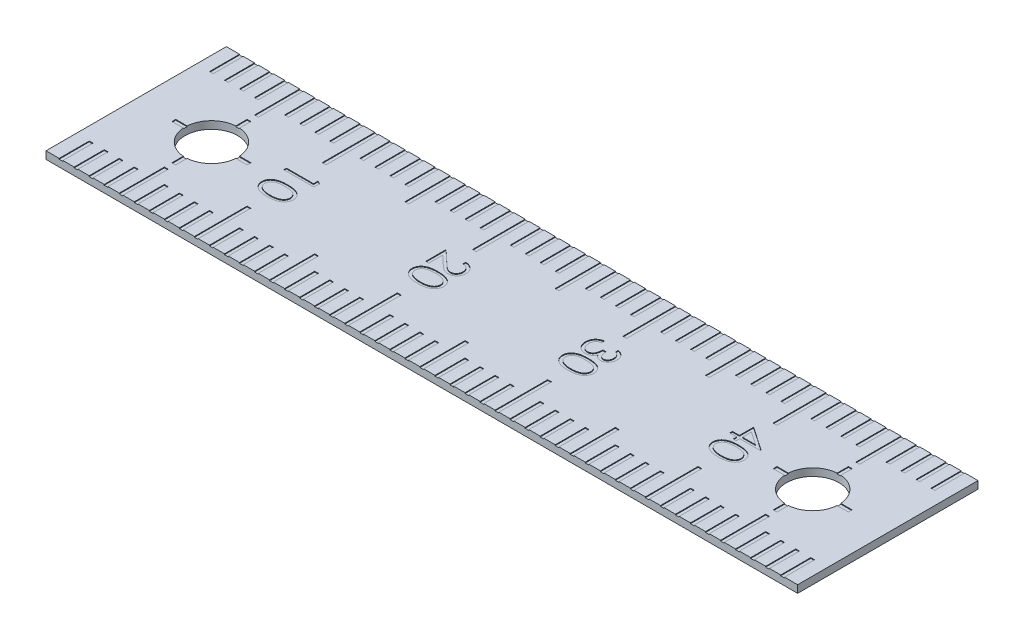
from build123d import *
from build123d.topology import SkipClean

# Parameters (mm, degrees)
BOSS_EXTRUDE1_DEPTH      = 0.5
SKETCH2_W                = 0.25
SKETCH2_H                = 2.0000000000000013
CUT_EXTRUDE2_DEPTH       = 0.05
LPATTERN2_COUNT          = 49
LPATTERN2_PITCH          = 1
SKETCH3_W                = 0.25
SKETCH3_H                = 1.4999999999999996
CUT_EXTRUDE3_DEPTH       = 0.05
LPATTERN3_COUNT          = 4
LPATTERN3_PITCH          = 10
SKETCH4_W                = 0.25
SKETCH4_H                = 0.9999999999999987
CUT_EXTRUDE4_DEPTH       = 0.05
LPATTERN4_COUNT          = 4
LPATTERN4_PITCH          = 10
LPATTERN4_COL_COUNT      = 2
LPATTERN4_COL_PITCH      = 10
CUT_EXTRUDE6_DEPTH       = 0.05
LPATTERN5_COUNT          = 2
LPATTERN5_PITCH          = 40
SKETCH20_R               = 1.750000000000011
CUT_EXTRUDE15_DEPTH      = 0.5
LPATTERN6_COUNT          = 2
LPATTERN6_PITCH          = 40
MIRROR1_COPY_1_SKETCH_W  = 0.25
MIRROR1_COPY_1_SKETCH_H  = 2.0000000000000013
MIRROR1_COPY_1_DEPTH     = 0.05
MIRROR1_COPY_2_SKETCH_W  = 0.25
MIRROR1_COPY_2_SKETCH_H  = 2.0000000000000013
MIRROR1_COPY_2_DEPTH     = 0.05
MIRROR1_COPY_3_SKETCH_W  = 0.25
MIRROR1_COPY_3_SKETCH_H  = 2.0000000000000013
MIRROR1_COPY_3_DEPTH     = 0.05
MIRROR1_COPY_4_SKETCH_W  = 0.25
MIRROR1_COPY_4_SKETCH_H  = 2.0000000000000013
MIRROR1_COPY_4_DEPTH     = 0.05
MIRROR1_COPY_5_SKETCH_W  = 0.25
MIRROR1_COPY_5_SKETCH_H  = 2.0000000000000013
MIRROR1_COPY_5_DEPTH     = 0.05
MIRROR1_COPY_6_SKETCH_W  = 0.25
MIRROR1_COPY_6_SKETCH_H  = 2.0000000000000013
MIRROR1_COPY_6_DEPTH     = 0.05
MIRROR1_COPY_7_SKETCH_W  = 0.25
MIRROR1_COPY_7_SKETCH_H  = 2.0000000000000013
MIRROR1_COPY_7_DEPTH     = 0.05
MIRROR1_COPY_8_SKETCH_W  = 0.25
MIRROR1_COPY_8_SKETCH_H  = 2.0000000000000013
MIRROR1_COPY_8_DEPTH     = 0.05
MIRROR1_COPY_9_SKETCH_W  = 0.25
MIRROR1_COPY_9_SKETCH_H  = 2.0000000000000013
MIRROR1_COPY_9_DEPTH     = 0.05
MIRROR1_COPY_10_SKETCH_W = 0.25
MIRROR1_COPY_10_SKETCH_H = 2.0000000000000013
MIRROR1_COPY_10_DEPTH    = 0.05
MIRROR1_COPY_11_SKETCH_W = 0.25
MIRROR1_COPY_11_SKETCH_H = 2.0000000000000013
MIRROR1_COPY_11_DEPTH    = 0.05
MIRROR1_COPY_12_SKETCH_W = 0.25
MIRROR1_COPY_12_SKETCH_H = 2.0000000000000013
MIRROR1_COPY_12_DEPTH    = 0.05
MIRROR1_COPY_13_SKETCH_W = 0.25
MIRROR1_COPY_13_SKETCH_H = 2.0000000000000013
MIRROR1_COPY_13_DEPTH    = 0.05
MIRROR1_COPY_14_SKETCH_W = 0.25
MIRROR1_COPY_14_SKETCH_H = 2.0000000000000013
MIRROR1_COPY_14_DEPTH    = 0.05
MIRROR1_COPY_15_SKETCH_W = 0.25
MIRROR1_COPY_15_SKETCH_H = 2.0000000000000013
MIRROR1_COPY_15_DEPTH    = 0.05
MIRROR1_COPY_16_SKETCH_W = 0.25
MIRROR1_COPY_16_SKETCH_H = 2.0000000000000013
MIRROR1_COPY_16_DEPTH    = 0.05
MIRROR1_COPY_17_SKETCH_W = 0.25
MIRROR1_COPY_17_SKETCH_H = 2.0000000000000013
MIRROR1_COPY_17_DEPTH    = 0.05
MIRROR1_COPY_18_SKETCH_W = 0.25
MIRROR1_COPY_18_SKETCH_H = 2.0000000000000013
MIRROR1_COPY_18_DEPTH    = 0.05
MIRROR1_COPY_19_SKETCH_W = 0.25
MIRROR1_COPY_19_SKETCH_H = 2.0000000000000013
MIRROR1_COPY_19_DEPTH    = 0.05
MIRROR1_COPY_20_SKETCH_W = 0.25
MIRROR1_COPY_20_SKETCH_H = 2.0000000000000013
MIRROR1_COPY_20_DEPTH    = 0.05
MIRROR1_COPY_21_SKETCH_W = 0.25
MIRROR1_COPY_21_SKETCH_H = 2.0000000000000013
MIRROR1_COPY_21_DEPTH    = 0.05
MIRROR1_COPY_22_SKETCH_W = 0.25
MIRROR1_COPY_22_SKETCH_H = 2.0000000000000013
MIRROR1_COPY_22_DEPTH    = 0.05
MIRROR1_COPY_23_SKETCH_W = 0.25
MIRROR1_COPY_23_SKETCH_H = 2.0000000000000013
MIRROR1_COPY_23_DEPTH    = 0.05
MIRROR1_COPY_24_SKETCH_W = 0.25
MIRROR1_COPY_24_SKETCH_H = 2.0000000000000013
MIRROR1_COPY_24_DEPTH    = 0.05
MIRROR1_COPY_25_SKETCH_W = 0.25
MIRROR1_COPY_25_SKETCH_H = 2.0000000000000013
MIRROR1_COPY_25_DEPTH    = 0.05
MIRROR1_COPY_26_SKETCH_W = 0.25
MIRROR1_COPY_26_SKETCH_H = 2.0000000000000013
MIRROR1_COPY_26_DEPTH    = 0.05
MIRROR1_COPY_27_SKETCH_W = 0.25
MIRROR1_COPY_27_SKETCH_H = 2.0000000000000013
MIRROR1_COPY_27_DEPTH    = 0.05
MIRROR1_COPY_28_SKETCH_W = 0.25
MIRROR1_COPY_28_SKETCH_H = 2.0000000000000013
MIRROR1_COPY_28_DEPTH    = 0.05
MIRROR1_COPY_29_SKETCH_W = 0.25
MIRROR1_COPY_29_SKETCH_H = 2.0000000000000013
MIRROR1_COPY_29_DEPTH    = 0.05
MIRROR1_COPY_30_SKETCH_W = 0.25
MIRROR1_COPY_30_SKETCH_H = 2.0000000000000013
MIRROR1_COPY_30_DEPTH    = 0.05
MIRROR1_COPY_31_SKETCH_W = 0.25
MIRROR1_COPY_31_SKETCH_H = 2.0000000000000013
MIRROR1_COPY_31_DEPTH    = 0.05
MIRROR1_COPY_32_SKETCH_W = 0.25
MIRROR1_COPY_32_SKETCH_H = 2.0000000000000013
MIRROR1_COPY_32_DEPTH    = 0.05
MIRROR1_COPY_33_SKETCH_W = 0.25
MIRROR1_COPY_33_SKETCH_H = 2.0000000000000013
MIRROR1_COPY_33_DEPTH    = 0.05
MIRROR1_COPY_34_SKETCH_W = 0.25
MIRROR1_COPY_34_SKETCH_H = 2.0000000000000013
MIRROR1_COPY_34_DEPTH    = 0.05
MIRROR1_COPY_35_SKETCH_W = 0.25
MIRROR1_COPY_35_SKETCH_H = 2.0000000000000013
MIRROR1_COPY_35_DEPTH    = 0.05
MIRROR1_COPY_36_SKETCH_W = 0.25
MIRROR1_COPY_36_SKETCH_H = 2.0000000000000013
MIRROR1_COPY_36_DEPTH    = 0.05
MIRROR1_COPY_37_SKETCH_W = 0.25
MIRROR1_COPY_37_SKETCH_H = 2.0000000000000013
MIRROR1_COPY_37_DEPTH    = 0.05
MIRROR1_COPY_38_SKETCH_W = 0.25
MIRROR1_COPY_38_SKETCH_H = 2.0000000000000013
MIRROR1_COPY_38_DEPTH    = 0.05
MIRROR1_COPY_39_SKETCH_W = 0.25
MIRROR1_COPY_39_SKETCH_H = 2.0000000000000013
MIRROR1_COPY_39_DEPTH    = 0.05
MIRROR1_COPY_40_SKETCH_W = 0.25
MIRROR1_COPY_40_SKETCH_H = 2.0000000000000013
MIRROR1_COPY_40_DEPTH    = 0.05
MIRROR1_COPY_41_SKETCH_W = 0.25
MIRROR1_COPY_41_SKETCH_H = 2.0000000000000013
MIRROR1_COPY_41_DEPTH    = 0.05
MIRROR1_COPY_42_SKETCH_W = 0.25
MIRROR1_COPY_42_SKETCH_H = 2.0000000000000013
MIRROR1_COPY_42_DEPTH    = 0.05
MIRROR1_COPY_43_SKETCH_W = 0.25
MIRROR1_COPY_43_SKETCH_H = 2.0000000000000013
MIRROR1_COPY_43_DEPTH    = 0.05
MIRROR1_COPY_44_SKETCH_W = 0.25
MIRROR1_COPY_44_SKETCH_H = 2.0000000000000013
MIRROR1_COPY_44_DEPTH    = 0.05
MIRROR1_COPY_45_SKETCH_W = 0.25
MIRROR1_COPY_45_SKETCH_H = 2.0000000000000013
MIRROR1_COPY_45_DEPTH    = 0.05
MIRROR1_COPY_46_SKETCH_W = 0.25
MIRROR1_COPY_46_SKETCH_H = 2.0000000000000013
MIRROR1_COPY_46_DEPTH    = 0.05
MIRROR1_COPY_47_SKETCH_W = 0.25
MIRROR1_COPY_47_SKETCH_H = 2.0000000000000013
MIRROR1_COPY_47_DEPTH    = 0.05
MIRROR1_COPY_48_SKETCH_W = 0.25
MIRROR1_COPY_48_SKETCH_H = 2.0000000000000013
MIRROR1_COPY_48_DEPTH    = 0.05
MIRROR1_COPY_49_SKETCH_W = 0.25
MIRROR1_COPY_49_SKETCH_H = 1.4999999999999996
MIRROR1_COPY_49_DEPTH    = 0.05
MIRROR1_COPY_50_SKETCH_W = 0.25
MIRROR1_COPY_50_SKETCH_H = 1.4999999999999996
MIRROR1_COPY_50_DEPTH    = 0.05
MIRROR1_COPY_51_SKETCH_W = 0.25
MIRROR1_COPY_51_SKETCH_H = 1.4999999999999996
MIRROR1_COPY_51_DEPTH    = 0.05
MIRROR1_COPY_52_SKETCH_W = 0.25
MIRROR1_COPY_52_SKETCH_H = 0.9999999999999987
MIRROR1_COPY_52_DEPTH    = 0.05
MIRROR1_COPY_53_SKETCH_W = 0.25
MIRROR1_COPY_53_SKETCH_H = 0.9999999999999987
MIRROR1_COPY_53_DEPTH    = 0.05
MIRROR1_COPY_54_SKETCH_W = 0.25
MIRROR1_COPY_54_SKETCH_H = 0.9999999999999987
MIRROR1_COPY_54_DEPTH    = 0.05
MIRROR1_COPY_55_SKETCH_W = 0.25
MIRROR1_COPY_55_SKETCH_H = 0.9999999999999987
MIRROR1_COPY_55_DEPTH    = 0.05
CUT_EXTRUDE16_DEPTH      = 0.05


with BuildPart() as part:
    # Sketch1 → Boss-Extrude1 (new body)
    with BuildSketch(Plane(origin=(0, 0, 0), x_dir=(1, 0, 0), z_dir=(0, 1, 0))):
        Polygon((-24.999999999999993, 6), (25, 6), (25.000000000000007, -6), (-24.999999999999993, -6), align=None)
    extrude(amount=-BOSS_EXTRUDE1_DEPTH)

    # Sketch2 → Cut-Extrude2 (cut)
    with BuildSketch(Plane(origin=(0, 0, 0), x_dir=(1, 0, 0), z_dir=(0, 1, 0))):
        with Locations((-23.999999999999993, 4.999999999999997)):
            Rectangle(SKETCH2_W, SKETCH2_H)
    cut_extrude2 = extrude(amount=-CUT_EXTRUDE2_DEPTH, mode=Mode.SUBTRACT)

    # LPattern2: Cut-Extrude2 ×49
    with Locations(*[(i * LPATTERN2_PITCH, 0, 0) for i in range(1, LPATTERN2_COUNT)]):
        add(cut_extrude2, mode=Mode.SUBTRACT)

    # Sketch3 → Cut-Extrude3 (cut)
    with BuildSketch(Plane(origin=(0, 0, 0), x_dir=(1, 0, 0), z_dir=(0, 1, 0))):
        with Locations((-14.999999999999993, 3.2499999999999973)):
            Rectangle(SKETCH3_W, SKETCH3_H)
    cut_extrude3 = extrude(amount=-CUT_EXTRUDE3_DEPTH, mode=Mode.SUBTRACT)

    # LPattern3: Cut-Extrude3 ×4
    with Locations(*[(i * LPATTERN3_PITCH, 0, 0) for i in range(1, LPATTERN3_COUNT)]):
        add(cut_extrude3, mode=Mode.SUBTRACT)

    # Sketch4 → Cut-Extrude4 (cut)
    with BuildSketch(Plane(origin=(0, 0, 0), x_dir=(1, 0, 0), z_dir=(0, 1, 0))):
        with Locations((-9.999999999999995, 3.4999999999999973)):
            Rectangle(SKETCH4_W, SKETCH4_H)
    cut_extrude4 = extrude(amount=-CUT_EXTRUDE4_DEPTH, mode=Mode.SUBTRACT)

    # LPattern4: Cut-Extrude4 ×4
    with Locations(*[(i * LPATTERN4_PITCH, 0, 0) for i in range(1, LPATTERN4_COUNT)]):
        add(cut_extrude4, mode=Mode.SUBTRACT)

    # LPattern4 col: Cut-Extrude4 ×2
    with Locations(*[(-i * LPATTERN4_COL_PITCH, 0, 0) for i in range(1, LPATTERN4_COL_COUNT)]):
        add(cut_extrude4, mode=Mode.SUBTRACT)

    # Sketch5 → Cut-Extrude6 (cut)
    with BuildSketch(Plane(origin=(0, 0, 0), x_dir=(1, 0, 0), z_dir=(0, 1, 0))):
        with BuildLine():
            Line((-20.119999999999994, 2.4999999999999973), (-19.869999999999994, 2.4999999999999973))
            Line((-19.869999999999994, 2.4999999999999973), (-19.86999999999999, 1.7455300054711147))
            ThreePointArc((-19.86999999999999, 1.7455300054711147), (-18.757563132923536, 1.2374368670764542), (-18.249469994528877, 0.12499999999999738))
            Line((-18.249469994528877, 0.12499999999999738), (-17.494999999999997, 0.1249999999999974))
            Line((-17.494999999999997, 0.1249999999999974), (-17.494999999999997, -0.1250000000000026))
            Line((-17.494999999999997, -0.1250000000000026), (-18.249469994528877, -0.12500000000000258))
            ThreePointArc((-18.249469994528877, -0.12500000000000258), (-18.757563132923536, -1.2374368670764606), (-19.869999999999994, -1.7455300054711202))
            Line((-19.869999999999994, -1.7455300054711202), (-19.86999999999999, -2.500000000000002))
            Line((-19.86999999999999, -2.500000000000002), (-20.119999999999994, -2.500000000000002))
            Line((-20.119999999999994, -2.500000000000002), (-20.119999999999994, -1.7455300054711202))
            ThreePointArc((-20.119999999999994, -1.7455300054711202), (-21.232436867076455, -1.2374368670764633), (-21.740530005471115, -0.12500000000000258))
            Line((-21.740530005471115, -0.12500000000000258), (-22.494999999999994, -0.1250000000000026))
            Line((-22.494999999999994, -0.1250000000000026), (-22.494999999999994, 0.1249999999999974))
            Line((-22.494999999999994, 0.1249999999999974), (-21.740530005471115, 0.12499999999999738))
            ThreePointArc((-21.740530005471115, 0.12499999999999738), (-21.23243686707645, 1.2374368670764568), (-20.11999999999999, 1.7455300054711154))
            Line((-20.11999999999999, 1.7455300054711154), (-20.119999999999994, 2.4999999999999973))
        make_face()
        with BuildLine():
            Line((-20.119999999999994, 1.4947825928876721), (-20.119999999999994, 0.1249999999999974))
            Line((-20.119999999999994, 0.1249999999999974), (-21.489782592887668, 0.1249999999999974))
            ThreePointArc((-21.489782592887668, 0.1249999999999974), (-21.055660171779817, 1.0606601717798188), (-20.119999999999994, 1.4947825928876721))
        make_face(mode=Mode.SUBTRACT)
        with BuildLine():
            Line((-19.869999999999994, 1.4947825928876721), (-19.869999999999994, 0.12499999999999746))
            Line((-19.869999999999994, 0.12499999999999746), (-18.500217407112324, 0.1249999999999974))
            ThreePointArc((-18.500217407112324, 0.1249999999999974), (-18.934339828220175, 1.0606601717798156), (-19.869999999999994, 1.4947825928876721))
        make_face(mode=Mode.SUBTRACT)
        with BuildLine():
            Line((-21.489782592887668, -0.1250000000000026), (-20.119999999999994, -0.1250000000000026))
            Line((-20.119999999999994, -0.1250000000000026), (-20.11999999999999, -1.4947825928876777))
            ThreePointArc((-20.11999999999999, -1.4947825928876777), (-21.055660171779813, -1.0606601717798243), (-21.489782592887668, -0.1250000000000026))
        make_face(mode=Mode.SUBTRACT)
        with BuildLine():
            Line((-19.869999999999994, -0.12500000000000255), (-19.86999999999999, -1.4947825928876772))
            ThreePointArc((-19.86999999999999, -1.4947825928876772), (-18.93433982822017, -1.0606601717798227), (-18.500217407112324, -0.12500000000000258))
            Line((-18.500217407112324, -0.12500000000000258), (-19.869999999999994, -0.12500000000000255))
        make_face(mode=Mode.SUBTRACT)
    cut_extrude6 = extrude(amount=-CUT_EXTRUDE6_DEPTH, mode=Mode.SUBTRACT)

    # LPattern5: Cut-Extrude6 ×2
    with Locations(*[(i * LPATTERN5_PITCH, 0, 0) for i in range(1, LPATTERN5_COUNT)]):
        add(cut_extrude6, mode=Mode.SUBTRACT)

    # Sketch20 → Cut-Extrude15 (cut)
    with SkipClean():  # the faces are left unmerged after this step: merging them gives an invalid solid
        with BuildSketch(Plane(origin=(0, 0, 0), x_dir=(1, 0, 0), z_dir=(0, 1, 0))):
            with Locations(Location((-19.994999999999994, -2.6e-15, 0), (0, 0, 270))):
                Circle(SKETCH20_R)
        cut_extrude15 = extrude(amount=-CUT_EXTRUDE15_DEPTH, mode=Mode.SUBTRACT)

    # LPattern6: Cut-Extrude15 ×2
    with Locations(*[(i * LPATTERN6_PITCH, 0, 0) for i in range(1, LPATTERN6_COUNT)]):
        add(cut_extrude15, mode=Mode.SUBTRACT)

    # Mirror1: Cut-Extrude2, Cut-Extrude3, Cut-Extrude4 across plane
    add(cut_extrude2.mirror(Plane.XY), mode=Mode.SUBTRACT)
    add(cut_extrude3.mirror(Plane.XY), mode=Mode.SUBTRACT)
    add(cut_extrude4.mirror(Plane.XY), mode=Mode.SUBTRACT)

    # Mirror1 copy 1 sketch → Mirror1 copy 1 (cut)
    with BuildSketch(Plane(origin=(1, 0, 0), x_dir=(1, 0, 0), z_dir=(0, 1, 0))):
        with Locations((-23.999999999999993, -4.999999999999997)):
            Rectangle(MIRROR1_COPY_1_SKETCH_W, MIRROR1_COPY_1_SKETCH_H)
    extrude(amount=-MIRROR1_COPY_1_DEPTH, mode=Mode.SUBTRACT)

    # Mirror1 copy 2 sketch → Mirror1 copy 2 (cut)
    with BuildSketch(Plane(origin=(2, 0, 0), x_dir=(1, 0, 0), z_dir=(0, 1, 0))):
        with Locations((-23.999999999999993, -4.999999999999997)):
            Rectangle(MIRROR1_COPY_2_SKETCH_W, MIRROR1_COPY_2_SKETCH_H)
    extrude(amount=-MIRROR1_COPY_2_DEPTH, mode=Mode.SUBTRACT)

    # Mirror1 copy 3 sketch → Mirror1 copy 3 (cut)
    with BuildSketch(Plane(origin=(3, 0, 0), x_dir=(1, 0, 0), z_dir=(0, 1, 0))):
        with Locations((-23.999999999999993, -4.999999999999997)):
            Rectangle(MIRROR1_COPY_3_SKETCH_W, MIRROR1_COPY_3_SKETCH_H)
    extrude(amount=-MIRROR1_COPY_3_DEPTH, mode=Mode.SUBTRACT)

    # Mirror1 copy 4 sketch → Mirror1 copy 4 (cut)
    with BuildSketch(Plane(origin=(4, 0, 0), x_dir=(1, 0, 0), z_dir=(0, 1, 0))):
        with Locations((-23.999999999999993, -4.999999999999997)):
            Rectangle(MIRROR1_COPY_4_SKETCH_W, MIRROR1_COPY_4_SKETCH_H)
    extrude(amount=-MIRROR1_COPY_4_DEPTH, mode=Mode.SUBTRACT)

    # Mirror1 copy 5 sketch → Mirror1 copy 5 (cut)
    with BuildSketch(Plane(origin=(5, 0, 0), x_dir=(1, 0, 0), z_dir=(0, 1, 0))):
        with Locations((-23.999999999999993, -4.999999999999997)):
            Rectangle(MIRROR1_COPY_5_SKETCH_W, MIRROR1_COPY_5_SKETCH_H)
    extrude(amount=-MIRROR1_COPY_5_DEPTH, mode=Mode.SUBTRACT)

    # Mirror1 copy 6 sketch → Mirror1 copy 6 (cut)
    with BuildSketch(Plane(origin=(6, 0, 0), x_dir=(1, 0, 0), z_dir=(0, 1, 0))):
        with Locations((-23.999999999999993, -4.999999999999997)):
            Rectangle(MIRROR1_COPY_6_SKETCH_W, MIRROR1_COPY_6_SKETCH_H)
    extrude(amount=-MIRROR1_COPY_6_DEPTH, mode=Mode.SUBTRACT)

    # Mirror1 copy 7 sketch → Mirror1 copy 7 (cut)
    with BuildSketch(Plane(origin=(7, 0, 0), x_dir=(1, 0, 0), z_dir=(0, 1, 0))):
        with Locations((-23.999999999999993, -4.999999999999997)):
            Rectangle(MIRROR1_COPY_7_SKETCH_W, MIRROR1_COPY_7_SKETCH_H)
    extrude(amount=-MIRROR1_COPY_7_DEPTH, mode=Mode.SUBTRACT)

    # Mirror1 copy 8 sketch → Mirror1 copy 8 (cut)
    with BuildSketch(Plane(origin=(8, 0, 0), x_dir=(1, 0, 0), z_dir=(0, 1, 0))):
        with Locations((-23.999999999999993, -4.999999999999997)):
            Rectangle(MIRROR1_COPY_8_SKETCH_W, MIRROR1_COPY_8_SKETCH_H)
    extrude(amount=-MIRROR1_COPY_8_DEPTH, mode=Mode.SUBTRACT)

    # Mirror1 copy 9 sketch → Mirror1 copy 9 (cut)
    with BuildSketch(Plane(origin=(9, 0, 0), x_dir=(1, 0, 0), z_dir=(0, 1, 0))):
        with Locations((-23.999999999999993, -4.999999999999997)):
            Rectangle(MIRROR1_COPY_9_SKETCH_W, MIRROR1_COPY_9_SKETCH_H)
    extrude(amount=-MIRROR1_COPY_9_DEPTH, mode=Mode.SUBTRACT)

    # Mirror1 copy 10 sketch → Mirror1 copy 10 (cut)
    with BuildSketch(Plane(origin=(10, 0, 0), x_dir=(1, 0, 0), z_dir=(0, 1, 0))):
        with Locations((-23.999999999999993, -4.999999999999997)):
            Rectangle(MIRROR1_COPY_10_SKETCH_W, MIRROR1_COPY_10_SKETCH_H)
    extrude(amount=-MIRROR1_COPY_10_DEPTH, mode=Mode.SUBTRACT)

    # Mirror1 copy 11 sketch → Mirror1 copy 11 (cut)
    with BuildSketch(Plane(origin=(11, 0, 0), x_dir=(1, 0, 0), z_dir=(0, 1, 0))):
        with Locations((-23.999999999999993, -4.999999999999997)):
            Rectangle(MIRROR1_COPY_11_SKETCH_W, MIRROR1_COPY_11_SKETCH_H)
    extrude(amount=-MIRROR1_COPY_11_DEPTH, mode=Mode.SUBTRACT)

    # Mirror1 copy 12 sketch → Mirror1 copy 12 (cut)
    with BuildSketch(Plane(origin=(12, 0, 0), x_dir=(1, 0, 0), z_dir=(0, 1, 0))):
        with Locations((-23.999999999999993, -4.999999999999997)):
            Rectangle(MIRROR1_COPY_12_SKETCH_W, MIRROR1_COPY_12_SKETCH_H)
    extrude(amount=-MIRROR1_COPY_12_DEPTH, mode=Mode.SUBTRACT)

    # Mirror1 copy 13 sketch → Mirror1 copy 13 (cut)
    with BuildSketch(Plane(origin=(13, 0, 0), x_dir=(1, 0, 0), z_dir=(0, 1, 0))):
        with Locations((-23.999999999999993, -4.999999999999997)):
            Rectangle(MIRROR1_COPY_13_SKETCH_W, MIRROR1_COPY_13_SKETCH_H)
    extrude(amount=-MIRROR1_COPY_13_DEPTH, mode=Mode.SUBTRACT)

    # Mirror1 copy 14 sketch → Mirror1 copy 14 (cut)
    with BuildSketch(Plane(origin=(14, 0, 0), x_dir=(1, 0, 0), z_dir=(0, 1, 0))):
        with Locations((-23.999999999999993, -4.999999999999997)):
            Rectangle(MIRROR1_COPY_14_SKETCH_W, MIRROR1_COPY_14_SKETCH_H)
    extrude(amount=-MIRROR1_COPY_14_DEPTH, mode=Mode.SUBTRACT)

    # Mirror1 copy 15 sketch → Mirror1 copy 15 (cut)
    with BuildSketch(Plane(origin=(15, 0, 0), x_dir=(1, 0, 0), z_dir=(0, 1, 0))):
        with Locations((-23.999999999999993, -4.999999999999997)):
            Rectangle(MIRROR1_COPY_15_SKETCH_W, MIRROR1_COPY_15_SKETCH_H)
    extrude(amount=-MIRROR1_COPY_15_DEPTH, mode=Mode.SUBTRACT)

    # Mirror1 copy 16 sketch → Mirror1 copy 16 (cut)
    with BuildSketch(Plane(origin=(16, 0, 0), x_dir=(1, 0, 0), z_dir=(0, 1, 0))):
        with Locations((-23.999999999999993, -4.999999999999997)):
            Rectangle(MIRROR1_COPY_16_SKETCH_W, MIRROR1_COPY_16_SKETCH_H)
    extrude(amount=-MIRROR1_COPY_16_DEPTH, mode=Mode.SUBTRACT)

    # Mirror1 copy 17 sketch → Mirror1 copy 17 (cut)
    with BuildSketch(Plane(origin=(17, 0, 0), x_dir=(1, 0, 0), z_dir=(0, 1, 0))):
        with Locations((-23.999999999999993, -4.999999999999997)):
            Rectangle(MIRROR1_COPY_17_SKETCH_W, MIRROR1_COPY_17_SKETCH_H)
    extrude(amount=-MIRROR1_COPY_17_DEPTH, mode=Mode.SUBTRACT)

    # Mirror1 copy 18 sketch → Mirror1 copy 18 (cut)
    with BuildSketch(Plane(origin=(18, 0, 0), x_dir=(1, 0, 0), z_dir=(0, 1, 0))):
        with Locations((-23.999999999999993, -4.999999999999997)):
            Rectangle(MIRROR1_COPY_18_SKETCH_W, MIRROR1_COPY_18_SKETCH_H)
    extrude(amount=-MIRROR1_COPY_18_DEPTH, mode=Mode.SUBTRACT)

    # Mirror1 copy 19 sketch → Mirror1 copy 19 (cut)
    with BuildSketch(Plane(origin=(19, 0, 0), x_dir=(1, 0, 0), z_dir=(0, 1, 0))):
        with Locations((-23.999999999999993, -4.999999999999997)):
            Rectangle(MIRROR1_COPY_19_SKETCH_W, MIRROR1_COPY_19_SKETCH_H)
    extrude(amount=-MIRROR1_COPY_19_DEPTH, mode=Mode.SUBTRACT)

    # Mirror1 copy 20 sketch → Mirror1 copy 20 (cut)
    with BuildSketch(Plane(origin=(20, 0, 0), x_dir=(1, 0, 0), z_dir=(0, 1, 0))):
        with Locations((-23.999999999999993, -4.999999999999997)):
            Rectangle(MIRROR1_COPY_20_SKETCH_W, MIRROR1_COPY_20_SKETCH_H)
    extrude(amount=-MIRROR1_COPY_20_DEPTH, mode=Mode.SUBTRACT)

    # Mirror1 copy 21 sketch → Mirror1 copy 21 (cut)
    with BuildSketch(Plane(origin=(21, 0, 0), x_dir=(1, 0, 0), z_dir=(0, 1, 0))):
        with Locations((-23.999999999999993, -4.999999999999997)):
            Rectangle(MIRROR1_COPY_21_SKETCH_W, MIRROR1_COPY_21_SKETCH_H)
    extrude(amount=-MIRROR1_COPY_21_DEPTH, mode=Mode.SUBTRACT)

    # Mirror1 copy 22 sketch → Mirror1 copy 22 (cut)
    with BuildSketch(Plane(origin=(22, 0, 0), x_dir=(1, 0, 0), z_dir=(0, 1, 0))):
        with Locations((-23.999999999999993, -4.999999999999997)):
            Rectangle(MIRROR1_COPY_22_SKETCH_W, MIRROR1_COPY_22_SKETCH_H)
    extrude(amount=-MIRROR1_COPY_22_DEPTH, mode=Mode.SUBTRACT)

    # Mirror1 copy 23 sketch → Mirror1 copy 23 (cut)
    with BuildSketch(Plane(origin=(23, 0, 0), x_dir=(1, 0, 0), z_dir=(0, 1, 0))):
        with Locations((-23.999999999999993, -4.999999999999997)):
            Rectangle(MIRROR1_COPY_23_SKETCH_W, MIRROR1_COPY_23_SKETCH_H)
    extrude(amount=-MIRROR1_COPY_23_DEPTH, mode=Mode.SUBTRACT)

    # Mirror1 copy 24 sketch → Mirror1 copy 24 (cut)
    with BuildSketch(Plane(origin=(24, 0, 0), x_dir=(1, 0, 0), z_dir=(0, 1, 0))):
        with Locations((-23.999999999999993, -4.999999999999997)):
            Rectangle(MIRROR1_COPY_24_SKETCH_W, MIRROR1_COPY_24_SKETCH_H)
    extrude(amount=-MIRROR1_COPY_24_DEPTH, mode=Mode.SUBTRACT)

    # Mirror1 copy 25 sketch → Mirror1 copy 25 (cut)
    with BuildSketch(Plane(origin=(25, 0, 0), x_dir=(1, 0, 0), z_dir=(0, 1, 0))):
        with Locations((-23.999999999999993, -4.999999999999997)):
            Rectangle(MIRROR1_COPY_25_SKETCH_W, MIRROR1_COPY_25_SKETCH_H)
    extrude(amount=-MIRROR1_COPY_25_DEPTH, mode=Mode.SUBTRACT)

    # Mirror1 copy 26 sketch → Mirror1 copy 26 (cut)
    with BuildSketch(Plane(origin=(26, 0, 0), x_dir=(1, 0, 0), z_dir=(0, 1, 0))):
        with Locations((-23.999999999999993, -4.999999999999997)):
            Rectangle(MIRROR1_COPY_26_SKETCH_W, MIRROR1_COPY_26_SKETCH_H)
    extrude(amount=-MIRROR1_COPY_26_DEPTH, mode=Mode.SUBTRACT)

    # Mirror1 copy 27 sketch → Mirror1 copy 27 (cut)
    with BuildSketch(Plane(origin=(27, 0, 0), x_dir=(1, 0, 0), z_dir=(0, 1, 0))):
        with Locations((-23.999999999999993, -4.999999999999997)):
            Rectangle(MIRROR1_COPY_27_SKETCH_W, MIRROR1_COPY_27_SKETCH_H)
    extrude(amount=-MIRROR1_COPY_27_DEPTH, mode=Mode.SUBTRACT)

    # Mirror1 copy 28 sketch → Mirror1 copy 28 (cut)
    with BuildSketch(Plane(origin=(28, 0, 0), x_dir=(1, 0, 0), z_dir=(0, 1, 0))):
        with Locations((-23.999999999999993, -4.999999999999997)):
            Rectangle(MIRROR1_COPY_28_SKETCH_W, MIRROR1_COPY_28_SKETCH_H)
    extrude(amount=-MIRROR1_COPY_28_DEPTH, mode=Mode.SUBTRACT)

    # Mirror1 copy 29 sketch → Mirror1 copy 29 (cut)
    with BuildSketch(Plane(origin=(29, 0, 0), x_dir=(1, 0, 0), z_dir=(0, 1, 0))):
        with Locations((-23.999999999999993, -4.999999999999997)):
            Rectangle(MIRROR1_COPY_29_SKETCH_W, MIRROR1_COPY_29_SKETCH_H)
    extrude(amount=-MIRROR1_COPY_29_DEPTH, mode=Mode.SUBTRACT)

    # Mirror1 copy 30 sketch → Mirror1 copy 30 (cut)
    with BuildSketch(Plane(origin=(30, 0, 0), x_dir=(1, 0, 0), z_dir=(0, 1, 0))):
        with Locations((-23.999999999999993, -4.999999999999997)):
            Rectangle(MIRROR1_COPY_30_SKETCH_W, MIRROR1_COPY_30_SKETCH_H)
    extrude(amount=-MIRROR1_COPY_30_DEPTH, mode=Mode.SUBTRACT)

    # Mirror1 copy 31 sketch → Mirror1 copy 31 (cut)
    with BuildSketch(Plane(origin=(31, 0, 0), x_dir=(1, 0, 0), z_dir=(0, 1, 0))):
        with Locations((-23.999999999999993, -4.999999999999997)):
            Rectangle(MIRROR1_COPY_31_SKETCH_W, MIRROR1_COPY_31_SKETCH_H)
    extrude(amount=-MIRROR1_COPY_31_DEPTH, mode=Mode.SUBTRACT)

    # Mirror1 copy 32 sketch → Mirror1 copy 32 (cut)
    with BuildSketch(Plane(origin=(32, 0, 0), x_dir=(1, 0, 0), z_dir=(0, 1, 0))):
        with Locations((-23.999999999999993, -4.999999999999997)):
            Rectangle(MIRROR1_COPY_32_SKETCH_W, MIRROR1_COPY_32_SKETCH_H)
    extrude(amount=-MIRROR1_COPY_32_DEPTH, mode=Mode.SUBTRACT)

    # Mirror1 copy 33 sketch → Mirror1 copy 33 (cut)
    with BuildSketch(Plane(origin=(33, 0, 0), x_dir=(1, 0, 0), z_dir=(0, 1, 0))):
        with Locations((-23.999999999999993, -4.999999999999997)):
            Rectangle(MIRROR1_COPY_33_SKETCH_W, MIRROR1_COPY_33_SKETCH_H)
    extrude(amount=-MIRROR1_COPY_33_DEPTH, mode=Mode.SUBTRACT)

    # Mirror1 copy 34 sketch → Mirror1 copy 34 (cut)
    with BuildSketch(Plane(origin=(34, 0, 0), x_dir=(1, 0, 0), z_dir=(0, 1, 0))):
        with Locations((-23.999999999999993, -4.999999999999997)):
            Rectangle(MIRROR1_COPY_34_SKETCH_W, MIRROR1_COPY_34_SKETCH_H)
    extrude(amount=-MIRROR1_COPY_34_DEPTH, mode=Mode.SUBTRACT)

    # Mirror1 copy 35 sketch → Mirror1 copy 35 (cut)
    with BuildSketch(Plane(origin=(35, 0, 0), x_dir=(1, 0, 0), z_dir=(0, 1, 0))):
        with Locations((-23.999999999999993, -4.999999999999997)):
            Rectangle(MIRROR1_COPY_35_SKETCH_W, MIRROR1_COPY_35_SKETCH_H)
    extrude(amount=-MIRROR1_COPY_35_DEPTH, mode=Mode.SUBTRACT)

    # Mirror1 copy 36 sketch → Mirror1 copy 36 (cut)
    with BuildSketch(Plane(origin=(36, 0, 0), x_dir=(1, 0, 0), z_dir=(0, 1, 0))):
        with Locations((-23.999999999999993, -4.999999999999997)):
            Rectangle(MIRROR1_COPY_36_SKETCH_W, MIRROR1_COPY_36_SKETCH_H)
    extrude(amount=-MIRROR1_COPY_36_DEPTH, mode=Mode.SUBTRACT)

    # Mirror1 copy 37 sketch → Mirror1 copy 37 (cut)
    with BuildSketch(Plane(origin=(37, 0, 0), x_dir=(1, 0, 0), z_dir=(0, 1, 0))):
        with Locations((-23.999999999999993, -4.999999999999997)):
            Rectangle(MIRROR1_COPY_37_SKETCH_W, MIRROR1_COPY_37_SKETCH_H)
    extrude(amount=-MIRROR1_COPY_37_DEPTH, mode=Mode.SUBTRACT)

    # Mirror1 copy 38 sketch → Mirror1 copy 38 (cut)
    with BuildSketch(Plane(origin=(38, 0, 0), x_dir=(1, 0, 0), z_dir=(0, 1, 0))):
        with Locations((-23.999999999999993, -4.999999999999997)):
            Rectangle(MIRROR1_COPY_38_SKETCH_W, MIRROR1_COPY_38_SKETCH_H)
    extrude(amount=-MIRROR1_COPY_38_DEPTH, mode=Mode.SUBTRACT)

    # Mirror1 copy 39 sketch → Mirror1 copy 39 (cut)
    with BuildSketch(Plane(origin=(39, 0, 0), x_dir=(1, 0, 0), z_dir=(0, 1, 0))):
        with Locations((-23.999999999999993, -4.999999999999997)):
            Rectangle(MIRROR1_COPY_39_SKETCH_W, MIRROR1_COPY_39_SKETCH_H)
    extrude(amount=-MIRROR1_COPY_39_DEPTH, mode=Mode.SUBTRACT)

    # Mirror1 copy 40 sketch → Mirror1 copy 40 (cut)
    with BuildSketch(Plane(origin=(40, 0, 0), x_dir=(1, 0, 0), z_dir=(0, 1, 0))):
        with Locations((-23.999999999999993, -4.999999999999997)):
            Rectangle(MIRROR1_COPY_40_SKETCH_W, MIRROR1_COPY_40_SKETCH_H)
    extrude(amount=-MIRROR1_COPY_40_DEPTH, mode=Mode.SUBTRACT)

    # Mirror1 copy 41 sketch → Mirror1 copy 41 (cut)
    with BuildSketch(Plane(origin=(41, 0, 0), x_dir=(1, 0, 0), z_dir=(0, 1, 0))):
        with Locations((-23.999999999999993, -4.999999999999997)):
            Rectangle(MIRROR1_COPY_41_SKETCH_W, MIRROR1_COPY_41_SKETCH_H)
    extrude(amount=-MIRROR1_COPY_41_DEPTH, mode=Mode.SUBTRACT)

    # Mirror1 copy 42 sketch → Mirror1 copy 42 (cut)
    with BuildSketch(Plane(origin=(42, 0, 0), x_dir=(1, 0, 0), z_dir=(0, 1, 0))):
        with Locations((-23.999999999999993, -4.999999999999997)):
            Rectangle(MIRROR1_COPY_42_SKETCH_W, MIRROR1_COPY_42_SKETCH_H)
    extrude(amount=-MIRROR1_COPY_42_DEPTH, mode=Mode.SUBTRACT)

    # Mirror1 copy 43 sketch → Mirror1 copy 43 (cut)
    with BuildSketch(Plane(origin=(43, 0, 0), x_dir=(1, 0, 0), z_dir=(0, 1, 0))):
        with Locations((-23.999999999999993, -4.999999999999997)):
            Rectangle(MIRROR1_COPY_43_SKETCH_W, MIRROR1_COPY_43_SKETCH_H)
    extrude(amount=-MIRROR1_COPY_43_DEPTH, mode=Mode.SUBTRACT)

    # Mirror1 copy 44 sketch → Mirror1 copy 44 (cut)
    with BuildSketch(Plane(origin=(44, 0, 0), x_dir=(1, 0, 0), z_dir=(0, 1, 0))):
        with Locations((-23.999999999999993, -4.999999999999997)):
            Rectangle(MIRROR1_COPY_44_SKETCH_W, MIRROR1_COPY_44_SKETCH_H)
    extrude(amount=-MIRROR1_COPY_44_DEPTH, mode=Mode.SUBTRACT)

    # Mirror1 copy 45 sketch → Mirror1 copy 45 (cut)
    with BuildSketch(Plane(origin=(45, 0, 0), x_dir=(1, 0, 0), z_dir=(0, 1, 0))):
        with Locations((-23.999999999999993, -4.999999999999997)):
            Rectangle(MIRROR1_COPY_45_SKETCH_W, MIRROR1_COPY_45_SKETCH_H)
    extrude(amount=-MIRROR1_COPY_45_DEPTH, mode=Mode.SUBTRACT)

    # Mirror1 copy 46 sketch → Mirror1 copy 46 (cut)
    with BuildSketch(Plane(origin=(46, 0, 0), x_dir=(1, 0, 0), z_dir=(0, 1, 0))):
        with Locations((-23.999999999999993, -4.999999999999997)):
            Rectangle(MIRROR1_COPY_46_SKETCH_W, MIRROR1_COPY_46_SKETCH_H)
    extrude(amount=-MIRROR1_COPY_46_DEPTH, mode=Mode.SUBTRACT)

    # Mirror1 copy 47 sketch → Mirror1 copy 47 (cut)
    with BuildSketch(Plane(origin=(47, 0, 0), x_dir=(1, 0, 0), z_dir=(0, 1, 0))):
        with Locations((-23.999999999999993, -4.999999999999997)):
            Rectangle(MIRROR1_COPY_47_SKETCH_W, MIRROR1_COPY_47_SKETCH_H)
    extrude(amount=-MIRROR1_COPY_47_DEPTH, mode=Mode.SUBTRACT)

    # Mirror1 copy 48 sketch → Mirror1 copy 48 (cut)
    with BuildSketch(Plane(origin=(48, 0, 0), x_dir=(1, 0, 0), z_dir=(0, 1, 0))):
        with Locations((-23.999999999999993, -4.999999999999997)):
            Rectangle(MIRROR1_COPY_48_SKETCH_W, MIRROR1_COPY_48_SKETCH_H)
    extrude(amount=-MIRROR1_COPY_48_DEPTH, mode=Mode.SUBTRACT)

    # Mirror1 copy 49 sketch → Mirror1 copy 49 (cut)
    with BuildSketch(Plane(origin=(10, 0, 0), x_dir=(1, 0, 0), z_dir=(0, 1, 0))):
        with Locations((-14.999999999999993, -3.2499999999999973)):
            Rectangle(MIRROR1_COPY_49_SKETCH_W, MIRROR1_COPY_49_SKETCH_H)
    extrude(amount=-MIRROR1_COPY_49_DEPTH, mode=Mode.SUBTRACT)

    # Mirror1 copy 50 sketch → Mirror1 copy 50 (cut)
    with BuildSketch(Plane(origin=(20, 0, 0), x_dir=(1, 0, 0), z_dir=(0, 1, 0))):
        with Locations((-14.999999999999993, -3.2499999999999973)):
            Rectangle(MIRROR1_COPY_50_SKETCH_W, MIRROR1_COPY_50_SKETCH_H)
    extrude(amount=-MIRROR1_COPY_50_DEPTH, mode=Mode.SUBTRACT)

    # Mirror1 copy 51 sketch → Mirror1 copy 51 (cut)
    with BuildSketch(Plane(origin=(30, 0, 0), x_dir=(1, 0, 0), z_dir=(0, 1, 0))):
        with Locations((-14.999999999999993, -3.2499999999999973)):
            Rectangle(MIRROR1_COPY_51_SKETCH_W, MIRROR1_COPY_51_SKETCH_H)
    extrude(amount=-MIRROR1_COPY_51_DEPTH, mode=Mode.SUBTRACT)

    # Mirror1 copy 52 sketch → Mirror1 copy 52 (cut)
    with BuildSketch(Plane(origin=(10, 0, 0), x_dir=(1, 0, 0), z_dir=(0, 1, 0))):
        with Locations((-9.999999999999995, -3.4999999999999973)):
            Rectangle(MIRROR1_COPY_52_SKETCH_W, MIRROR1_COPY_52_SKETCH_H)
    extrude(amount=-MIRROR1_COPY_52_DEPTH, mode=Mode.SUBTRACT)

    # Mirror1 copy 53 sketch → Mirror1 copy 53 (cut)
    with BuildSketch(Plane(origin=(20, 0, 0), x_dir=(1, 0, 0), z_dir=(0, 1, 0))):
        with Locations((-9.999999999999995, -3.4999999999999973)):
            Rectangle(MIRROR1_COPY_53_SKETCH_W, MIRROR1_COPY_53_SKETCH_H)
    extrude(amount=-MIRROR1_COPY_53_DEPTH, mode=Mode.SUBTRACT)

    # Mirror1 copy 54 sketch → Mirror1 copy 54 (cut)
    with BuildSketch(Plane(origin=(30, 0, 0), x_dir=(1, 0, 0), z_dir=(0, 1, 0))):
        with Locations((-9.999999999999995, -3.4999999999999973)):
            Rectangle(MIRROR1_COPY_54_SKETCH_W, MIRROR1_COPY_54_SKETCH_H)
    extrude(amount=-MIRROR1_COPY_54_DEPTH, mode=Mode.SUBTRACT)

    # Mirror1 copy 55 sketch → Mirror1 copy 55 (cut)
    with BuildSketch(Plane(origin=(-10, 0, 0), x_dir=(1, 0, 0), z_dir=(0, 1, 0))):
        with Locations((-9.999999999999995, -3.4999999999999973)):
            Rectangle(MIRROR1_COPY_55_SKETCH_W, MIRROR1_COPY_55_SKETCH_H)
    extrude(amount=-MIRROR1_COPY_55_DEPTH, mode=Mode.SUBTRACT)

    # Sketch24 → Cut-Extrude16 (cut)
    # profile 1 of 8: a face of its own
    with BuildSketch(Plane(origin=(0, 0, 0), x_dir=(1, 0, 0), z_dir=(0, 1, 0))):
        Polygon((-13.999999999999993, 1.1903044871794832), (-13.999999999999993, 0.8205128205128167), (-15.999999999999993, 0.8205128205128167), (-15.999999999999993, 0.9999999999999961), (-14.205128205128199, 0.9999999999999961), (-14.205128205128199, 1.3076923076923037), align=None)
    # profile 2 of 8: a face of its own
    with BuildSketch(Plane(origin=(0, 0, 0), x_dir=(1, 0, 0), z_dir=(0, 1, 0))):
        with BuildLine():
            add(Edge.make_bspline(
                [(-15.000801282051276, 0.07692307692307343), (-14.968745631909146, 0.07673563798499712), (-14.906477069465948, 0.07637153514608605), (-14.81574298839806, 0.07232100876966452), (-14.730622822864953, 0.06559224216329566), (-14.651112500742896, 0.05637088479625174), (-14.577191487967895, 0.04514918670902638), (-14.509057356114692, 0.03016889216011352), (-14.446394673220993, 0.01313306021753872), (-14.388999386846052, -0.00661138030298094), (-14.336097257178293, -0.02888947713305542), (-14.28671349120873, -0.05313988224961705), (-14.240910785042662, -0.08031176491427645), (-14.198001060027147, -0.10889859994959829), (-14.158463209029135, -0.1399450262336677), (-14.122372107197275, -0.1731235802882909), (-14.089705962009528, -0.20876338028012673), (-14.060075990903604, -0.24615955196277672), (-14.034264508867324, -0.285548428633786), (-14.011006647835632, -0.3257157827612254), (-13.991917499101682, -0.36737039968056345), (-13.976232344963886, -0.4101323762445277), (-13.963664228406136, -0.4538773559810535), (-13.954960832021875, -0.49878608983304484), (-13.949506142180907, -0.544869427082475), (-13.948983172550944, -0.5759727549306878), (-13.948717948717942, -0.5917467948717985)],
                knots=[0, 0, 0, 0, 1.6463772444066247, 3.198111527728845, 4.663803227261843, 6.031090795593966, 7.308794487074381, 8.502186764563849, 9.612154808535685, 10.64254533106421, 11.617106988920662, 12.55886617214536, 13.465886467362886, 14.350532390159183, 15.20542558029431, 16.045215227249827, 16.865619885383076, 17.6862252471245, 18.492864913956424, 19.282407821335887, 20.068097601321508, 20.84284203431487, 21.62016324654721, 22.40309347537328, 23.190129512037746, 24, 24, 24, 24], degree=3))
            add(Edge.make_bspline(
                [(-13.948717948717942, -0.5917467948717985), (-13.948996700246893, -0.6076527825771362), (-13.949551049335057, -0.639284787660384), (-13.954879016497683, -0.6860507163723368), (-13.963719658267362, -0.7317362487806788), (-13.976245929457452, -0.7761466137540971), (-13.99178631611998, -0.8196466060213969), (-14.011264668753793, -0.8618959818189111), (-14.033938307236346, -0.903157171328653), (-14.06058052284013, -0.9427744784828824), (-14.090284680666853, -0.981182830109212), (-14.123863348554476, -1.0174388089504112), (-14.160977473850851, -1.0515457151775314), (-14.201229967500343, -1.0839316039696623), (-14.245392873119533, -1.1136776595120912), (-14.292698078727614, -1.1420053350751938), (-14.343972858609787, -1.1673607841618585), (-14.398361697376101, -1.191780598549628), (-14.457369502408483, -1.2128588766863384), (-14.520663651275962, -1.2318681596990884), (-14.588991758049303, -1.2472275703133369), (-14.661995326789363, -1.2600214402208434), (-14.739942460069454, -1.2699328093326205), (-14.822666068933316, -1.277151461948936), (-14.910220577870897, -1.2809646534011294), (-14.970082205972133, -1.2816827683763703), (-15.000801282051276, -1.2820512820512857)],
                knots=[0, 0, 0, 0, 0.8109147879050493, 1.6126543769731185, 2.396697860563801, 3.1815986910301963, 3.9636281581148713, 4.749916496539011, 5.551656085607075, 6.361998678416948, 7.182127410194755, 8.02556559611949, 8.87862776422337, 9.750805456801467, 10.657531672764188, 11.591944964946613, 12.560506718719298, 13.572878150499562, 14.630710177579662, 15.753379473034, 16.941251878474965, 18.199788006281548, 19.531962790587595, 20.947069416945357, 22.43333350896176, 24, 24, 24, 24], degree=3))
            add(Edge.make_bspline(
                [(-15.000801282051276, -1.2820512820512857), (-15.031386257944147, -1.2816784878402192), (-15.090979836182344, -1.2809521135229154), (-15.178141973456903, -1.2771992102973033), (-15.260421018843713, -1.2697719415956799), (-15.338046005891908, -1.260585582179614), (-15.410556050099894, -1.2474997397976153), (-15.478640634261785, -1.2326234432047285), (-15.541712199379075, -1.2141338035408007), (-15.60040880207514, -1.1933428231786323), (-15.65453117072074, -1.169452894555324), (-15.705362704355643, -1.1438733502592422), (-15.752629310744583, -1.1157195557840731), (-15.796791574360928, -1.0857961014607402), (-15.837393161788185, -1.0536854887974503), (-15.874534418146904, -1.0194341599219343), (-15.90819084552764, -0.9830160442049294), (-15.938300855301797, -0.9445208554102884), (-15.964632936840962, -0.9042803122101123), (-15.988169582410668, -0.8631568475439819), (-16.007268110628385, -0.8203296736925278), (-16.02339336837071, -0.7767505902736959), (-16.035948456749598, -0.7320084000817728), (-16.044544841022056, -0.6861469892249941), (-16.050590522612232, -0.6393165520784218), (-16.0510507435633, -0.6076582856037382), (-16.051282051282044, -0.5917467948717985)],
                knots=[0, 0, 0, 0, 1.5613064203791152, 3.0421418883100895, 4.451772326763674, 5.7775658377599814, 7.03055808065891, 8.211376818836, 9.33316471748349, 10.383253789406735, 11.387583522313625, 12.350962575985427, 13.286244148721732, 14.193812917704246, 15.072134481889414, 15.92598933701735, 16.77021126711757, 17.600669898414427, 18.417446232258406, 19.223253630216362, 20.016477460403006, 20.807971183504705, 21.59360136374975, 22.385065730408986, 23.18833168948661, 23.999999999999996, 23.999999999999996, 23.999999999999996, 23.999999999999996], degree=3))
            add(Edge.make_bspline(
                [(-16.051282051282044, -0.5917467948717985), (-16.051014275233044, -0.575973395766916), (-16.050486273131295, -0.5448713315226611), (-16.045068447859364, -0.49877873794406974), (-16.036233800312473, -0.453940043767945), (-16.02423639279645, -0.41026561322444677), (-16.008988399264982, -0.36766606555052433), (-15.989593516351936, -0.32655870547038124), (-15.967098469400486, -0.2864006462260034), (-15.941506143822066, -0.24737513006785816), (-15.912178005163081, -0.21022596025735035), (-15.87974195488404, -0.17474029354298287), (-15.843384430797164, -0.14181412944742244), (-15.803687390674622, -0.11115681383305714), (-15.760987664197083, -0.08206468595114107), (-15.714864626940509, -0.05515906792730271), (-15.665018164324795, -0.03095596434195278), (-15.611823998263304, -0.00817859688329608), (-15.554006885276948, 0.01189960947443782), (-15.491009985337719, 0.02950130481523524), (-15.42248481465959, 0.04417478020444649), (-15.348634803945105, 0.05597526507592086), (-15.2694046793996, 0.06570357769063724), (-15.184654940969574, 0.07228914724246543), (-15.094458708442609, 0.07637476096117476), (-15.032590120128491, 0.07673696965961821), (-15.000801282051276, 0.07692307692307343)],
                knots=[0, 0, 0, 0, 0.8109408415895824, 1.5990170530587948, 2.3829820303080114, 3.1594797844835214, 3.9264413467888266, 4.706938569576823, 5.494146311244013, 6.2923341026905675, 7.104379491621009, 7.925868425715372, 8.762126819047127, 9.623561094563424, 10.503686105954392, 11.417833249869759, 12.366995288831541, 13.351843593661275, 14.392337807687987, 15.51222974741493, 16.713911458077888, 17.99439110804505, 19.357476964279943, 20.81825921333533, 22.365182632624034, 24, 24, 24, 24], degree=3))
        make_face()
        with BuildLine():
            add(Edge.make_bspline(
                [(-14.999999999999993, -0.10256410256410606), (-15.026713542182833, -0.10263235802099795), (-15.078559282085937, -0.10276482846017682), (-15.153898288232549, -0.10622551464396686), (-15.224167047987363, -0.11093993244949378), (-15.289454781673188, -0.11702067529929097), (-15.349540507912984, -0.1260509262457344), (-15.404837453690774, -0.1361691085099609), (-15.45505307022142, -0.1484822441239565), (-15.500531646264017, -0.1630510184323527), (-15.542045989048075, -0.17964413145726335), (-15.58067319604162, -0.1977640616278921), (-15.616881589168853, -0.21721921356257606), (-15.650303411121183, -0.23903050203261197), (-15.681271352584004, -0.26270319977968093), (-15.709696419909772, -0.2882761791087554), (-15.735454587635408, -0.31570446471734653), (-15.766019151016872, -0.3536742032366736), (-15.797977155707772, -0.40355447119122), (-15.82546347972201, -0.46672409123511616), (-15.842848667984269, -0.5316620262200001), (-15.845053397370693, -0.5757504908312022), (-15.84615384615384, -0.5977564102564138)],
                knots=[0, 0, 0, 0, 1.4591160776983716, 2.831857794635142, 4.118796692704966, 5.306371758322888, 6.412361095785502, 7.436813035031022, 8.376339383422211, 9.234574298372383, 10.043323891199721, 10.816788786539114, 11.564361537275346, 12.286735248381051, 12.994408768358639, 13.691741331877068, 14.37297542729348, 15.047457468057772, 16.35281191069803, 17.59428529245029, 18.799233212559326, 20, 20, 20, 20], degree=3))
            add(Edge.make_bspline(
                [(-15.84615384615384, -0.5977564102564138), (-15.845240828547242, -0.619903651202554), (-15.84341667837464, -0.6641524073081), (-15.825817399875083, -0.7288002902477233), (-15.799263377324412, -0.7915604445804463), (-15.767864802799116, -0.8407444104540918), (-15.737962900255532, -0.8781630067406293), (-15.712468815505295, -0.9049727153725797), (-15.68392260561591, -0.9295796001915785), (-15.653123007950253, -0.95291792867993), (-15.619481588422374, -0.9743231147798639), (-15.583160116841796, -0.9937877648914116), (-15.544057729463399, -1.0115496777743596), (-15.516760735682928, -1.021669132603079), (-15.502804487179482, -1.0268429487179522)],
                knots=[0, 0, 0, 0, 1.3537608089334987, 2.7047266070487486, 4.0751377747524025, 5.516104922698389, 6.260822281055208, 7.007110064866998, 7.77808973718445, 8.566572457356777, 9.372053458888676, 10.217411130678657, 11.088608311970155, 12, 12, 12, 12], degree=3))
            add(Edge.make_bspline(
                [(-15.502804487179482, -1.0268429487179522), (-15.48495892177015, -1.0328725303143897), (-15.448724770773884, -1.0451151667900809), (-15.392516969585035, -1.060893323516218), (-15.333543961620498, -1.0733192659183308), (-15.272158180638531, -1.0844983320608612), (-15.20790692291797, -1.0921286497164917), (-15.140988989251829, -1.0982702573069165), (-15.071353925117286, -1.1018877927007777), (-15.024042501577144, -1.102336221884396), (-14.999999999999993, -1.102564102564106)],
                knots=[0, 0, 0, 0, 0.8847067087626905, 1.7963340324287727, 2.7400279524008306, 3.714592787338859, 4.726048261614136, 5.777819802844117, 6.870742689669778, 8, 8, 8, 8], degree=3))
            add(Edge.make_bspline(
                [(-14.999999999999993, -1.102564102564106), (-14.975958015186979, -1.1023127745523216), (-14.928920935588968, -1.101821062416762), (-14.86010564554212, -1.0985904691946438), (-14.794631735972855, -1.093399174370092), (-14.732439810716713, -1.0863728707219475), (-14.673640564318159, -1.0767272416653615), (-14.618149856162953, -1.0651438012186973), (-14.565982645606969, -1.0515635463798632), (-14.517004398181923, -1.035986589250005), (-14.47139115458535, -1.0184315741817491), (-14.429043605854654, -0.9990385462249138), (-14.389737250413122, -0.9783435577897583), (-14.353584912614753, -0.9558614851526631), (-14.320423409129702, -0.9318641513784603), (-14.290917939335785, -0.9057169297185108), (-14.264153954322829, -0.8784573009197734), (-14.233603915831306, -0.8402760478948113), (-14.202454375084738, -0.7902907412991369), (-14.173788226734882, -0.7280932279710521), (-14.157326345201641, -0.6633671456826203), (-14.155005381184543, -0.6196108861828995), (-14.153846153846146, -0.5977564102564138)],
                knots=[0, 0, 0, 0, 1.3136686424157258, 2.5701345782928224, 3.7633462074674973, 4.90200494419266, 5.988887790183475, 7.017888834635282, 7.998425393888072, 8.933058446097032, 9.8247445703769, 10.667209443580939, 11.47676519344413, 12.250262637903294, 12.9917043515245, 13.710426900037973, 14.401925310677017, 15.076585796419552, 16.37838513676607, 17.60978793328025, 18.806186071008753, 20, 20, 20, 20], degree=3))
            add(Edge.make_bspline(
                [(-14.153846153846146, -0.5977564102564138), (-14.155005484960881, -0.5756351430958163), (-14.157326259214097, -0.5313523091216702), (-14.17374505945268, -0.465967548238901), (-14.20218748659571, -0.403326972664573), (-14.23380506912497, -0.353742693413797), (-14.263613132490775, -0.3156096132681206), (-14.289534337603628, -0.2886823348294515), (-14.31804539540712, -0.26350813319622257), (-14.348882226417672, -0.2398157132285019), (-14.382320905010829, -0.21802542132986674), (-14.418524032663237, -0.19856230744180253), (-14.457154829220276, -0.18045277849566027), (-14.498659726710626, -0.16382404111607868), (-14.544206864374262, -0.14939028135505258), (-14.594169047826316, -0.13648916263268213), (-14.649517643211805, -0.12637711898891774), (-14.709771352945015, -0.11755292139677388), (-14.775139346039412, -0.11082497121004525), (-14.845570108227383, -0.10623761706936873), (-14.921039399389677, -0.10275856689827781), (-14.97315264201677, -0.10263022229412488), (-14.999999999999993, -0.10256410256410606)],
                knots=[0, 0, 0, 0, 1.2079646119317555, 2.4181298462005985, 3.6557951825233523, 4.9510049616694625, 5.6208951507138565, 6.296795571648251, 6.989224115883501, 7.696855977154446, 8.419187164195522, 9.1667159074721, 9.940135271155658, 10.748837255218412, 11.607021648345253, 12.548275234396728, 13.565499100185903, 14.678641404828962, 15.87414091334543, 17.15372626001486, 18.533675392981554, 20, 20, 20, 20], degree=3))
        make_face(mode=Mode.SUBTRACT)
    # profile 3 of 8: a face of its own
    with BuildSketch(Plane(origin=(0, 0, 0), x_dir=(1, 0, 0), z_dir=(0, 1, 0))):
        with BuildLine():
            Line((-4.615384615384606, 1.3589743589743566), (-4.615384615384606, 1.538461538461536))
            add(Edge.make_bspline(
                [(-4.615384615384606, 1.538461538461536), (-4.59157256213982, 1.537291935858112), (-4.544806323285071, 1.534994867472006), (-4.47662289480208, 1.5242330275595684), (-4.411442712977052, 1.5088484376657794), (-4.349824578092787, 1.4870448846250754), (-4.2910324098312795, 1.4601194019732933), (-4.235846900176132, 1.4271548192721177), (-4.183720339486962, 1.3888538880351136), (-4.13563965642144, 1.3452868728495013), (-4.091687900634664, 1.2980126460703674), (-4.053331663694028, 1.247314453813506), (-4.021295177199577, 1.1937133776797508), (-3.9943677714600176, 1.1376743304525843), (-3.974180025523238, 1.078549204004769), (-3.9591944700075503, 1.0169031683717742), (-3.950179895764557, 0.9524575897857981), (-3.9492108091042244, 0.9085490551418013), (-3.94871794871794, 0.8862179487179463)],
                knots=[0, 0, 0, 0, 1.1007762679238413, 2.161895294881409, 3.184016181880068, 4.190939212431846, 5.1765005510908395, 6.166955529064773, 7.155448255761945, 8.160289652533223, 9.160174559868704, 10.133824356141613, 11.091467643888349, 12.040886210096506, 13.000931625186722, 13.972173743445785, 14.968683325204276, 15.999999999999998, 15.999999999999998, 15.999999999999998, 15.999999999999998], degree=3))
            add(Edge.make_bspline(
                [(-3.94871794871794, 0.8862179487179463), (-3.9492313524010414, 0.8642876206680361), (-3.95024017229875, 0.8211953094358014), (-3.958903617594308, 0.758302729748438), (-3.9724725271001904, 0.6984299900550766), (-3.9915099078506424, 0.6416941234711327), (-4.017101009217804, 0.5885478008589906), (-4.047842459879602, 0.5385917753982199), (-4.083396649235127, 0.491231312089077), (-4.125255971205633, 0.44859886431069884), (-4.169943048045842, 0.40945139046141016), (-4.217650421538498, 0.3756786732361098), (-4.266924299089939, 0.3467568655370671), (-4.318140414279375, 0.3226496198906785), (-4.371781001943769, 0.30490325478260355), (-4.42706511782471, 0.29142999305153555), (-4.48456500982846, 0.2838143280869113), (-4.5234830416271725, 0.2826455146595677), (-4.543269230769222, 0.28205128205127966)],
                knots=[0, 0, 0, 0, 1.1116073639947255, 2.184268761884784, 3.212621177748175, 4.221274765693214, 5.211760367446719, 6.196651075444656, 7.192147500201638, 8.207485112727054, 9.220403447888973, 10.201281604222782, 11.16644169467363, 12.114753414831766, 13.065576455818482, 14.02645073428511, 14.996634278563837, 16, 16, 16, 16], degree=3))
            add(Edge.make_bspline(
                [(-4.543269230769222, 0.28205128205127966), (-4.571125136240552, 0.2830188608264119), (-4.62634811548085, 0.2849370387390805), (-4.7074994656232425, 0.30134525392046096), (-4.786124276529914, 0.3269718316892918), (-4.849402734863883, 0.3578274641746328), (-4.9003933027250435, 0.38895457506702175), (-4.9423754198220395, 0.417004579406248), (-4.987578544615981, 0.4498416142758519), (-5.035851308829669, 0.48794361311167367), (-5.087571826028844, 0.5305223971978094), (-5.142708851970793, 0.5779636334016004), (-5.2006927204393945, 0.6306056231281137), (-5.24029592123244, 0.6675533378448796), (-5.260817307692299, 0.6866987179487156)],
                knots=[0, 0, 0, 0, 1.1844263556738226, 2.348067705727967, 3.5090691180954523, 4.6961105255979, 5.333549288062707, 6.050745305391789, 6.844228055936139, 7.710549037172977, 8.667450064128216, 9.695053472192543, 10.805634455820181, 12, 12, 12, 12], degree=3))
            Line((-5.260817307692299, 0.6866987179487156), (-5.794871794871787, 1.1870993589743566))
            Line((-5.794871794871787, 1.1870993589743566), (-5.794871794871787, 0.256410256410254))
            Line((-5.794871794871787, 0.256410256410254), (-5.999999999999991, 0.256410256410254))
            Line((-5.999999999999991, 0.256410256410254), (-5.999999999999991, 1.6153846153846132))
            Line((-5.999999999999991, 1.6153846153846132), (-5.1722756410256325, 0.8397435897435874))
            add(Edge.make_bspline(
                [(-5.1722756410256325, 0.8397435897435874), (-5.152563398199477, 0.8208577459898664), (-5.114700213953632, 0.7845819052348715), (-5.059404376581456, 0.7332951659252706), (-5.008165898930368, 0.6871573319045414), (-4.960757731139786, 0.6461377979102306), (-4.91744863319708, 0.610202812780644), (-4.87789920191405, 0.5794673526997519), (-4.842448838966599, 0.5537955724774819), (-4.800803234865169, 0.526588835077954), (-4.749896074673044, 0.5006454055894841), (-4.687997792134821, 0.4778437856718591), (-4.624137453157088, 0.4640399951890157), (-4.580995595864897, 0.4623756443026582), (-4.559294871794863, 0.4615384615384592)],
                knots=[0, 0, 0, 0, 1.3295300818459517, 2.5537551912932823, 3.672934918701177, 4.687409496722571, 5.606792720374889, 6.413407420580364, 7.126401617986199, 7.737995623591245, 8.834647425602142, 9.900448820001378, 10.943907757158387, 12, 12, 12, 12], degree=3))
            add(Edge.make_bspline(
                [(-4.559294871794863, 0.4615384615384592), (-4.5456468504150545, 0.4618980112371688), (-4.518749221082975, 0.46260661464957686), (-4.479338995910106, 0.4689788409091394), (-4.441175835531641, 0.47834090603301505), (-4.404731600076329, 0.4927707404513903), (-4.369289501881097, 0.5101076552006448), (-4.335927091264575, 0.5322568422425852), (-4.303507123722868, 0.5575675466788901), (-4.273141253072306, 0.5869267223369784), (-4.24532140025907, 0.6191576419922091), (-4.220679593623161, 0.653212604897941), (-4.200085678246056, 0.6892409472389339), (-4.1832037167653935, 0.7270925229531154), (-4.1699606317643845, 0.7666613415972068), (-4.160784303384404, 0.8080240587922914), (-4.155022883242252, 0.8510663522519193), (-4.1542433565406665, 0.8804569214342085), (-4.153846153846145, 0.89543269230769)],
                knots=[0, 0, 0, 0, 0.9915046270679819, 1.9540652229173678, 2.8959859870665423, 3.8425986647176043, 4.797835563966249, 5.759220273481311, 6.747868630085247, 7.784730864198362, 8.824135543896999, 9.839918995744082, 10.835834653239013, 11.835434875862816, 12.848616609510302, 13.863796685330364, 14.911511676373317, 16, 16, 16, 16], degree=3))
            add(Edge.make_bspline(
                [(-4.153846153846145, 0.89543269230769), (-4.15425462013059, 0.9110732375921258), (-4.155056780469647, 0.9417886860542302), (-4.160671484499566, 0.9868842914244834), (-4.170348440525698, 1.0299083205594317), (-4.183615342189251, 1.0709478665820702), (-4.2003184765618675, 1.1100424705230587), (-4.221524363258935, 1.146838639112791), (-4.2464050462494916, 1.1816723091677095), (-4.274767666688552, 1.214479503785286), (-4.306494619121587, 1.2446241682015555), (-4.341426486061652, 1.2716663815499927), (-4.379790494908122, 1.2947305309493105), (-4.420720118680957, 1.3151758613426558), (-4.465303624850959, 1.3308195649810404), (-4.512460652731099, 1.3441916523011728), (-4.562861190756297, 1.353905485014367), (-4.597586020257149, 1.3572566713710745), (-4.615384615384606, 1.3589743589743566)],
                knots=[0, 0, 0, 0, 1.031212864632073, 2.0251317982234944, 2.99075744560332, 3.9347812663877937, 4.865570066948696, 5.788494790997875, 6.729227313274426, 7.6843567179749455, 8.6435771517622, 9.610526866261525, 10.590658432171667, 11.590954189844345, 12.62164056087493, 13.700587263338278, 14.821410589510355, 16, 16, 16, 16], degree=3))
        make_face()
    # profile 4 of 8: a face of its own
    with BuildSketch(Plane(origin=(0, 0, 0), x_dir=(1, 0, 0), z_dir=(0, 1, 0))):
        with BuildLine():
            add(Edge.make_bspline(
                [(-5.000801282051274, 0.07692307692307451), (-4.968745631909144, 0.0767356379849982), (-4.90647706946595, 0.07637153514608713), (-4.815742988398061, 0.07232100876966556), (-4.730622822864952, 0.06559224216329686), (-4.6511125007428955, 0.05637088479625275), (-4.577191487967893, 0.04514918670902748), (-4.509057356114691, 0.03016889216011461), (-4.446394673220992, 0.0131330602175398), (-4.388999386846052, -0.00661138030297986), (-4.336097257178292, -0.02888947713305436), (-4.286713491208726, -0.05313988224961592), (-4.240910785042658, -0.0803117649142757), (-4.1980010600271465, -0.10889859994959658), (-4.158463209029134, -0.13994502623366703), (-4.122372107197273, -0.1731235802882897), (-4.089705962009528, -0.20876338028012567), (-4.060075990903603, -0.24615955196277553), (-4.034264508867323, -0.2855484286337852), (-4.011006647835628, -0.3257157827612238), (-3.9919174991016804, -0.3673703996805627), (-3.976232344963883, -0.41013237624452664), (-3.9636642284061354, -0.4538773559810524), (-3.9549608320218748, -0.49878608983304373), (-3.9495061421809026, -0.5448694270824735), (-3.948983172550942, -0.5759727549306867), (-3.94871794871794, -0.5917467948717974)],
                knots=[0, 0, 0, 0, 1.6463772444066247, 3.198111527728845, 4.663803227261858, 6.0310907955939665, 7.3087944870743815, 8.50218676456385, 9.612154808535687, 10.642545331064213, 11.617106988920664, 12.558866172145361, 13.465886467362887, 14.350532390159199, 15.205425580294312, 16.04521522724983, 16.86561988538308, 17.686225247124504, 18.492864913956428, 19.282407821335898, 20.06809760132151, 20.842842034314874, 21.620163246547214, 22.403093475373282, 23.19012951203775, 24, 24, 24, 24], degree=3))
            add(Edge.make_bspline(
                [(-3.94871794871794, -0.5917467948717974), (-3.9489967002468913, -0.6076527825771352), (-3.9495510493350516, -0.6392847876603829), (-3.9548790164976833, -0.6860507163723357), (-3.963719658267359, -0.7317362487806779), (-3.976245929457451, -0.7761466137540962), (-3.991786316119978, -0.8196466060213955), (-4.011264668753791, -0.8618959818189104), (-4.033938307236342, -0.903157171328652), (-4.060580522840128, -0.9427744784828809), (-4.090284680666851, -0.9811828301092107), (-4.123863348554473, -1.017438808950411), (-4.160977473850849, -1.0515457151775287), (-4.201229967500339, -1.0839316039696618), (-4.245392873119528, -1.1136776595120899), (-4.292698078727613, -1.1420053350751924), (-4.3439728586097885, -1.1673607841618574), (-4.3983616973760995, -1.191780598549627), (-4.457369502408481, -1.2128588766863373), (-4.520663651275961, -1.231868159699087), (-4.588991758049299, -1.2472275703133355), (-4.661995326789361, -1.260021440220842), (-4.739942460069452, -1.2699328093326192), (-4.822666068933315, -1.2771514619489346), (-4.910220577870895, -1.280964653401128), (-4.9700822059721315, -1.281682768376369), (-5.000801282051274, -1.2820512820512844)],
                knots=[0, 0, 0, 0, 0.8109147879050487, 1.6126543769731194, 2.396697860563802, 3.181598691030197, 3.9636281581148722, 4.749916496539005, 5.551656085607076, 6.361998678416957, 7.182127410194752, 8.025565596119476, 8.878627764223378, 9.750805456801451, 10.657531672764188, 11.59194496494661, 12.560506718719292, 13.572878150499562, 14.630710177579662, 15.753379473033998, 16.941251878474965, 18.199788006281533, 19.531962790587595, 20.947069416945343, 22.433333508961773, 24, 24, 24, 24], degree=3))
            add(Edge.make_bspline(
                [(-5.000801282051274, -1.2820512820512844), (-5.031386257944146, -1.2816784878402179), (-5.090979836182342, -1.280952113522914), (-5.178141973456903, -1.277199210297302), (-5.260421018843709, -1.2697719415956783), (-5.338046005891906, -1.2605855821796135), (-5.410556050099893, -1.2474997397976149), (-5.478640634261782, -1.2326234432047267), (-5.541712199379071, -1.2141338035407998), (-5.600408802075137, -1.1933428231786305), (-5.654531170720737, -1.1694528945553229), (-5.705362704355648, -1.1438733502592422), (-5.752629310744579, -1.1157195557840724), (-5.796791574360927, -1.085796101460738), (-5.837393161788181, -1.0536854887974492), (-5.874534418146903, -1.0194341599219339), (-5.908190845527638, -0.9830160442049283), (-5.938300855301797, -0.944520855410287), (-5.964632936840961, -0.9042803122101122), (-5.988169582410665, -0.8631568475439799), (-6.00726811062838, -0.8203296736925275), (-6.02339336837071, -0.7767505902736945), (-6.035948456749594, -0.7320084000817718), (-6.044544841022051, -0.686146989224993), (-6.050590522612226, -0.6393165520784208), (-6.051050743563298, -0.607658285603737), (-6.051282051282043, -0.5917467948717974)],
                knots=[0, 0, 0, 0, 1.56130642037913, 3.0421418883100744, 4.451772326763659, 5.777565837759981, 7.030558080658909, 8.211376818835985, 9.33316471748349, 10.383253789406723, 11.387583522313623, 12.35096257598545, 13.286244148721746, 14.193812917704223, 15.072134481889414, 15.925989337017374, 16.770211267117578, 17.600669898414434, 18.41744623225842, 19.223253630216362, 20.016477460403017, 20.80797118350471, 21.593601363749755, 22.38506573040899, 23.18833168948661, 23.999999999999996, 23.999999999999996, 23.999999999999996, 23.999999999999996], degree=3))
            add(Edge.make_bspline(
                [(-6.051282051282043, -0.5917467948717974), (-6.051014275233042, -0.575973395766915), (-6.050486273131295, -0.54487133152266), (-6.045068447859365, -0.4987787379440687), (-6.0362338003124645, -0.4539400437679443), (-6.024236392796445, -0.4102656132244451), (-6.008988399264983, -0.36766606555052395), (-5.989593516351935, -0.32655870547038), (-5.967098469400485, -0.28640064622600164), (-5.941506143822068, -0.24737513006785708), (-5.912178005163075, -0.2102259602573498), (-5.879741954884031, -0.17474029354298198), (-5.843384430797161, -0.1418141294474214), (-5.8036873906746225, -0.11115681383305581), (-5.760987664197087, -0.08206468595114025), (-5.714864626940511, -0.0551590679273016), (-5.665018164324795, -0.03095596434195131), (-5.6118239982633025, -0.00817859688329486), (-5.554006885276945, 0.01189960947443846), (-5.49100998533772, 0.02950130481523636), (-5.42248481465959, 0.04417478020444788), (-5.348634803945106, 0.0559752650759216), (-5.269404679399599, 0.0657035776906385), (-5.184654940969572, 0.07228914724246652), (-5.094458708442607, 0.07637476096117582), (-5.032590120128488, 0.0767369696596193), (-5.000801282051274, 0.07692307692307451)],
                knots=[0, 0, 0, 0, 0.8109408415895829, 1.5990170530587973, 2.3829820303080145, 3.1594797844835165, 3.926441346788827, 4.706938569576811, 5.494146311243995, 6.292334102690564, 7.104379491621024, 7.925868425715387, 8.76212681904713, 9.623561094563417, 10.503686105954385, 11.417833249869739, 12.36699528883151, 13.351843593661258, 14.392337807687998, 15.512229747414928, 16.71391145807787, 17.99439110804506, 19.357476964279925, 20.818259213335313, 22.36518263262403, 23.999999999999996, 23.999999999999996, 23.999999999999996, 23.999999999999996], degree=3))
        make_face()
        with BuildLine():
            add(Edge.make_bspline(
                [(-4.999999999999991, -0.10256410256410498), (-5.026713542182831, -0.10263235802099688), (-5.078559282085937, -0.10276482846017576), (-5.153898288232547, -0.10622551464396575), (-5.22416704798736, -0.11093993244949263), (-5.289454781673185, -0.11702067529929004), (-5.34954050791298, -0.12605092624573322), (-5.4048374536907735, -0.13616910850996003), (-5.455053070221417, -0.14848224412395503), (-5.500531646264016, -0.1630510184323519), (-5.542045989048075, -0.17964413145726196), (-5.580673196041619, -0.19776406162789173), (-5.616881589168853, -0.21721921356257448), (-5.650303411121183, -0.23903050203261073), (-5.681271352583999, -0.26270319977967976), (-5.709696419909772, -0.2882761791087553), (-5.735454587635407, -0.31570446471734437), (-5.766019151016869, -0.35367420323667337), (-5.797977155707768, -0.4035544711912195), (-5.825463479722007, -0.46672409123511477), (-5.842848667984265, -0.5316620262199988), (-5.845053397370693, -0.5757504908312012), (-5.846153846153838, -0.5977564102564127)],
                knots=[0, 0, 0, 0, 1.4591160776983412, 2.8318577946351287, 4.1187966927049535, 5.306371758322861, 6.412361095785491, 7.436813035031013, 8.376339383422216, 9.234574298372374, 10.043323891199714, 10.816788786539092, 11.564361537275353, 12.286735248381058, 12.994408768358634, 13.691741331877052, 14.372975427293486, 15.047457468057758, 16.35281191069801, 17.59428529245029, 18.799233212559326, 20, 20, 20, 20], degree=3))
            add(Edge.make_bspline(
                [(-5.846153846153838, -0.5977564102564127), (-5.8452408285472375, -0.6199036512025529), (-5.843416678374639, -0.6641524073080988), (-5.825817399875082, -0.7288002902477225), (-5.799263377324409, -0.7915604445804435), (-5.767864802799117, -0.8407444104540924), (-5.737962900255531, -0.8781630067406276), (-5.712468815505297, -0.9049727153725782), (-5.683922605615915, -0.9295796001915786), (-5.65312300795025, -0.9529179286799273), (-5.619481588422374, -0.9743231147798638), (-5.583160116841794, -0.9937877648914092), (-5.5440577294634, -1.0115496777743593), (-5.516760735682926, -1.021669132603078), (-5.502804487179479, -1.0268429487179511)],
                knots=[0, 0, 0, 0, 1.3537608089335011, 2.704726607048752, 4.075137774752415, 5.516104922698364, 6.260822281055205, 7.007110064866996, 7.778089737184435, 8.566572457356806, 9.372053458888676, 10.217411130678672, 11.088608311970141, 12, 12, 12, 12], degree=3))
            add(Edge.make_bspline(
                [(-5.502804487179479, -1.0268429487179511), (-5.484958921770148, -1.0328725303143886), (-5.448724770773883, -1.0451151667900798), (-5.392516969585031, -1.0608933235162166), (-5.333543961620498, -1.0733192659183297), (-5.27215818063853, -1.0844983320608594), (-5.207906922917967, -1.092128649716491), (-5.140988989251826, -1.098270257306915), (-5.071353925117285, -1.1018877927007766), (-5.024042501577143, -1.102336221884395), (-4.999999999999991, -1.102564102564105)],
                knots=[0, 0, 0, 0, 0.8847067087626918, 1.796334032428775, 2.7400279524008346, 3.7145927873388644, 4.726048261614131, 5.777819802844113, 6.87074268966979, 8, 8, 8, 8], degree=3))
            add(Edge.make_bspline(
                [(-4.999999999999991, -1.102564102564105), (-4.975958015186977, -1.1023127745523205), (-4.928920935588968, -1.1018210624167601), (-4.860105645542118, -1.0985904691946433), (-4.7946317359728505, -1.093399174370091), (-4.732439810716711, -1.0863728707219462), (-4.673640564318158, -1.0767272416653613), (-4.618149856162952, -1.065143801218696), (-4.565982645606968, -1.051563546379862), (-4.51700439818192, -1.0359865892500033), (-4.471391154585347, -1.018431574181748), (-4.42904360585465, -0.9990385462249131), (-4.389737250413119, -0.9783435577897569), (-4.353584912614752, -0.9558614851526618), (-4.320423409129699, -0.9318641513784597), (-4.290917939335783, -0.9057169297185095), (-4.26415395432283, -0.8784573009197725), (-4.233603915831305, -0.8402760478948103), (-4.202454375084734, -0.7902907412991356), (-4.173788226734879, -0.7280932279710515), (-4.157326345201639, -0.6633671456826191), (-4.155005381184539, -0.6196108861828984), (-4.153846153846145, -0.5977564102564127)],
                knots=[0, 0, 0, 0, 1.3136686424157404, 2.570134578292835, 3.7633462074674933, 4.9020049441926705, 5.988887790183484, 7.017888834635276, 7.9984253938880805, 8.933058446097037, 9.824744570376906, 10.667209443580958, 11.476765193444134, 12.250262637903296, 12.991704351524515, 13.710426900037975, 14.401925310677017, 15.076585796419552, 16.378385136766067, 17.609787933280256, 18.806186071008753, 20, 20, 20, 20], degree=3))
            add(Edge.make_bspline(
                [(-4.153846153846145, -0.5977564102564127), (-4.155005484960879, -0.5756351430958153), (-4.157326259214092, -0.5313523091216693), (-4.173745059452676, -0.46596754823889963), (-4.202187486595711, -0.40332697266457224), (-4.233805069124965, -0.3537426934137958), (-4.263613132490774, -0.3156096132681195), (-4.289534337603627, -0.28868233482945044), (-4.318045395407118, -0.2635081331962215), (-4.348882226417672, -0.23981571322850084), (-4.382320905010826, -0.2180254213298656), (-4.418524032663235, -0.19856230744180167), (-4.4571548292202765, -0.180452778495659), (-4.498659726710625, -0.16382404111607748), (-4.54420686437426, -0.1493902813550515), (-4.5941690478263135, -0.1364891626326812), (-4.649517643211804, -0.12637711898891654), (-4.7097713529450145, -0.11755292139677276), (-4.775139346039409, -0.11082497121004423), (-4.845570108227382, -0.10623761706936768), (-4.9210393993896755, -0.10275856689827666), (-4.9731526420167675, -0.10263022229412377), (-4.999999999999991, -0.10256410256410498)],
                knots=[0, 0, 0, 0, 1.2079646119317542, 2.418129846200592, 3.6557951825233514, 4.95100496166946, 5.620895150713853, 6.296795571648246, 6.989224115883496, 7.696855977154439, 8.419187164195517, 9.166715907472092, 9.940135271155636, 10.74883725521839, 11.607021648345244, 12.548275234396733, 13.56549910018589, 14.67864140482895, 15.874140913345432, 17.15372626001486, 18.533675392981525, 20, 20, 20, 20], degree=3))
        make_face(mode=Mode.SUBTRACT)
    # profile 5 of 8: a face of its own
    with BuildSketch(Plane(origin=(0, 0, 0), x_dir=(1, 0, 0), z_dir=(0, 1, 0))):
        with BuildLine():
            Line((5.538461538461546, 1.3589743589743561), (5.538461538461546, 1.5384615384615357))
            add(Edge.make_bspline(
                [(5.538461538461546, 1.5384615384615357), (5.558594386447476, 1.5335989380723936), (5.5979524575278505, 1.524092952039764), (5.654185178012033, 1.5042657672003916), (5.707398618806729, 1.4826661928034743), (5.756596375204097, 1.4567295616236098), (5.802767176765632, 1.4284388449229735), (5.844863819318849, 1.3960258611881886), (5.883956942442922, 1.360986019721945), (5.918650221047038, 1.3222289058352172), (5.950066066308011, 1.281583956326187), (5.976851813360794, 1.2384784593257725), (5.999894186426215, 1.1937796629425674), (6.018877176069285, 1.1471778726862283), (6.03317747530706, 1.0985343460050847), (6.043552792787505, 1.0482888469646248), (6.050290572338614, 0.9963097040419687), (6.050948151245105, 0.9610253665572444), (6.051282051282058, 0.9431089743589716)],
                knots=[0, 0, 0, 0, 1.1620055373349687, 2.271625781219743, 3.3437588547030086, 4.383309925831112, 5.3902295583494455, 6.379919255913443, 7.36185416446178, 8.333198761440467, 9.295911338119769, 10.242430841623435, 11.17795921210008, 12.116337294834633, 13.062827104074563, 14.020064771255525, 14.994644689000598, 15.999999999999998, 15.999999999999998, 15.999999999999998, 15.999999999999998], degree=3))
            add(Edge.make_bspline(
                [(6.051282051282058, 0.9431089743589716), (6.050493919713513, 0.9170045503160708), (6.048934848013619, 0.8653651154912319), (6.034698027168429, 0.7895005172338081), (6.012169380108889, 0.7163423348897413), (5.981041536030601, 0.6466913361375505), (5.9426487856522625, 0.5819950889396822), (5.896954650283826, 0.5244315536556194), (5.844840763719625, 0.47478097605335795), (5.787279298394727, 0.4331270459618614), (5.72576186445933, 0.4005127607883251), (5.662447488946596, 0.3764634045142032), (5.597486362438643, 0.3618224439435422), (5.5536250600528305, 0.3599249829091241), (5.5316506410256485, 0.3589743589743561)],
                knots=[0, 0, 0, 0, 1.0830509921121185, 2.1424774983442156, 3.193116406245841, 4.255571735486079, 5.302633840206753, 6.308962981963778, 7.297363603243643, 8.282367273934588, 9.249857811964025, 10.179914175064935, 11.08814088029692, 12, 12, 12, 12], degree=3))
            add(Edge.make_bspline(
                [(5.5316506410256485, 0.3589743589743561), (5.510503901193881, 0.35963926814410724), (5.469123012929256, 0.36094039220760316), (5.408710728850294, 0.37198822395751), (5.351772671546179, 0.39058037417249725), (5.298069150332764, 0.4163345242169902), (5.247940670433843, 0.449672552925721), (5.201274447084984, 0.490056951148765), (5.157863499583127, 0.5377727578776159), (5.1329952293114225, 0.5739321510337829), (5.1201923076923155, 0.5925480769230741)],
                knots=[0, 0, 0, 0, 1.0245403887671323, 2.0048665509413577, 2.965041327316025, 3.920577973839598, 4.882998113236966, 5.874504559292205, 6.905732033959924, 8, 8, 8, 8], degree=3))
            add(Edge.make_bspline(
                [(5.1201923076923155, 0.5925480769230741), (5.109919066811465, 0.5712727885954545), (5.089564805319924, 0.5291202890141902), (5.049647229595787, 0.4716628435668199), (5.003557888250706, 0.4195040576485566), (4.967590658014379, 0.39041621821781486), (4.949519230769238, 0.3758012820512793)],
                knots=[0, 0, 0, 0, 1.0155184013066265, 2.0120356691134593, 3.001164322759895, 4, 4, 4, 4], degree=3))
            add(Edge.make_bspline(
                [(4.949519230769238, 0.3758012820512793), (4.936344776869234, 0.36617374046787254), (4.9102116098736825, 0.34707631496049), (4.86817028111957, 0.3235703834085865), (4.825802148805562, 0.30200210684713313), (4.781441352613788, 0.286128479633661), (4.736512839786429, 0.27243016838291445), (4.690054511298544, 0.2634171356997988), (4.642507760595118, 0.2576311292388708), (4.610326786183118, 0.2568186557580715), (4.5941506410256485, 0.2564102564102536)],
                knots=[0, 0, 0, 0, 1.0251640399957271, 2.0335403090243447, 3.025129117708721, 4.011046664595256, 4.991655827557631, 5.976607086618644, 6.9829177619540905, 7.999999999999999, 7.999999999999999, 7.999999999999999, 7.999999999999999], degree=3))
            add(Edge.make_bspline(
                [(4.5941506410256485, 0.2564102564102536), (4.56614619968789, 0.2574379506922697), (4.510269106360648, 0.25948850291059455), (4.42769541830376, 0.277742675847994), (4.347117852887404, 0.30620481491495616), (4.26973030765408, 0.34591673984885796), (4.197475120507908, 0.3950508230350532), (4.133119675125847, 0.4538296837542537), (4.077428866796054, 0.5208244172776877), (4.0310479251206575, 0.5955965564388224), (3.993945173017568, 0.676570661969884), (3.968199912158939, 0.7631872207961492), (3.9514302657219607, 0.8541867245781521), (3.9496321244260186, 0.9165909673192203), (3.948717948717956, 0.9483173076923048)],
                knots=[0, 0, 0, 0, 0.9557004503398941, 1.906903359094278, 2.8751975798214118, 3.868912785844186, 4.8699329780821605, 5.851730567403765, 6.8366399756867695, 7.836775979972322, 8.849487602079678, 9.86990889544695, 10.91706088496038, 12, 12, 12, 12], degree=3))
            add(Edge.make_bspline(
                [(3.948717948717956, 0.9483173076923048), (3.949214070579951, 0.9696997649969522), (3.9501902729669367, 1.011773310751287), (3.9568637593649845, 1.0736267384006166), (3.969052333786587, 1.1326677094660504), (3.985454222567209, 1.1889760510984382), (4.006249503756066, 1.2426017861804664), (4.032145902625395, 1.2933812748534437), (4.062609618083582, 1.341626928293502), (4.098000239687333, 1.3868834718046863), (4.137589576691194, 1.429145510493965), (4.182080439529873, 1.4672899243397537), (4.230650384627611, 1.501952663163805), (4.283863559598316, 1.5322055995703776), (4.341032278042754, 1.559426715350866), (4.402888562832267, 1.581815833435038), (4.468879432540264, 1.6015218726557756), (4.514866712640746, 1.6106838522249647), (4.538461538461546, 1.6153846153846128)],
                knots=[0, 0, 0, 0, 1.0486587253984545, 2.063410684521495, 3.046034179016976, 4.001477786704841, 4.936774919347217, 5.862367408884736, 6.792675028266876, 7.730719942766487, 8.675894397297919, 9.627829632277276, 10.600096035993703, 11.597688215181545, 12.62604526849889, 13.701542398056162, 14.820723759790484, 16, 16, 16, 16], degree=3))
            Line((4.538461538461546, 1.6153846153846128), (4.538461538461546, 1.4358974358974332))
            add(Edge.make_bspline(
                [(4.538461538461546, 1.4358974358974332), (4.523062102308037, 1.4312212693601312), (4.493108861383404, 1.422125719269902), (4.4500001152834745, 1.4066432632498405), (4.410481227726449, 1.3890042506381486), (4.374262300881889, 1.3700816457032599), (4.340986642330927, 1.3502082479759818), (4.311534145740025, 1.3279711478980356), (4.284611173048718, 1.3050173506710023), (4.269442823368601, 1.2877148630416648), (4.262019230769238, 1.279246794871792)],
                knots=[0, 0, 0, 0, 1.198163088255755, 2.3305312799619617, 3.407730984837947, 4.417276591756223, 5.372219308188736, 6.288973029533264, 7.162600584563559, 8, 8, 8, 8], degree=3))
            add(Edge.make_bspline(
                [(4.262019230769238, 1.279246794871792), (4.253385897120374, 1.268048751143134), (4.236145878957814, 1.2456872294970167), (4.214144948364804, 1.2092482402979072), (4.195081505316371, 1.1709254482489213), (4.180519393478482, 1.1298884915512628), (4.168189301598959, 1.0870229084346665), (4.160120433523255, 1.0416358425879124), (4.154584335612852, 0.9941277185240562), (4.1540958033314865, 0.9616889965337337), (4.15384615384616, 0.9451121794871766)],
                knots=[0, 0, 0, 0, 0.9461704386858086, 1.8894202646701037, 2.8453034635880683, 3.8072333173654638, 4.801018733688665, 5.828864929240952, 6.890507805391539, 8, 8, 8, 8], degree=3))
            add(Edge.make_bspline(
                [(4.15384615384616, 0.9451121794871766), (4.154197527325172, 0.9263956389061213), (4.154884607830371, 0.8897970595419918), (4.161221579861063, 0.836397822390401), (4.170410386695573, 0.7855809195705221), (4.184783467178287, 0.7378649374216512), (4.202026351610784, 0.6926005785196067), (4.224600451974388, 0.6507982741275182), (4.250094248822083, 0.611229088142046), (4.279748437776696, 0.5750522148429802), (4.311801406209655, 0.5424369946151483), (4.345806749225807, 0.514253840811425), (4.380710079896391, 0.4898440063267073), (4.417325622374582, 0.47022257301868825), (4.45529420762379, 0.454701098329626), (4.494757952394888, 0.4441411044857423), (4.535384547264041, 0.43679689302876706), (4.5630011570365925, 0.43619889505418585), (4.576923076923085, 0.4358974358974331)],
                knots=[0, 0, 0, 0, 1.2169902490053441, 2.3797193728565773, 3.4939923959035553, 4.57156149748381, 5.616923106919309, 6.638958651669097, 7.65577506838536, 8.674704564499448, 9.676001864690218, 10.625896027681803, 11.543994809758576, 12.441854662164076, 13.32265773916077, 14.205728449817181, 15.095482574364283, 16, 16, 16, 16], degree=3))
            add(Edge.make_bspline(
                [(4.576923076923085, 0.4358974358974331), (4.595558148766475, 0.43677187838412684), (4.632735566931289, 0.4385164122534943), (4.687431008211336, 0.4518358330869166), (4.740131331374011, 0.473742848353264), (4.789929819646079, 0.504416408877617), (4.836105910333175, 0.5417375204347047), (4.877145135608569, 0.5853449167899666), (4.911348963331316, 0.6353455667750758), (4.9348935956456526, 0.6816613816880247), (4.9505851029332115, 0.7227853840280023), (4.961587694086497, 0.7579085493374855), (4.970382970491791, 0.7972647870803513), (4.978890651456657, 0.8403816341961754), (4.986022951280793, 0.8874409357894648), (4.991996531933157, 0.9384850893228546), (4.996768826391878, 0.9935346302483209), (4.998901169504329, 1.0316437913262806), (5.000000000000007, 1.0512820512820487)],
                knots=[0, 0, 0, 0, 1.0704819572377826, 2.135637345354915, 3.2163665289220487, 4.339485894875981, 5.485746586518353, 6.620975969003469, 7.768829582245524, 8.95680439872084, 9.598399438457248, 10.297751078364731, 11.07057027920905, 11.91524846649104, 12.824061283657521, 13.805856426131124, 14.869322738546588, 16, 16, 16, 16], degree=3))
            Line((5.000000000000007, 1.0512820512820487), (5.205128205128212, 1.0512820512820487))
            add(Edge.make_bspline(
                [(5.205128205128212, 1.0512820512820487), (5.205549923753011, 1.0265392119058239), (5.2063759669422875, 0.978074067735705), (5.216297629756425, 0.9072676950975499), (5.230176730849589, 0.8394789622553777), (5.250944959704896, 0.7762552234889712), (5.275872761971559, 0.7188169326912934), (5.303980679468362, 0.6687110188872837), (5.3358256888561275, 0.6271249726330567), (5.3709898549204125, 0.5939548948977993), (5.409144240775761, 0.5696092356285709), (5.448494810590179, 0.5513354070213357), (5.48995712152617, 0.540622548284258), (5.518237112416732, 0.5391844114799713), (5.53245192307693, 0.5384615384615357)],
                knots=[0, 0, 0, 0, 1.32170857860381, 2.588902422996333, 3.8155265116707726, 5.016621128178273, 6.1387577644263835, 7.158873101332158, 8.079948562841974, 8.928590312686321, 9.728601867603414, 10.489025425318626, 11.240515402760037, 12, 12, 12, 12], degree=3))
            add(Edge.make_bspline(
                [(5.53245192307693, 0.5384615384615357), (5.542896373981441, 0.5386983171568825), (5.56367511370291, 0.5391693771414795), (5.594031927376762, 0.5451110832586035), (5.623462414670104, 0.5540375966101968), (5.65183303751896, 0.5663175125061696), (5.678979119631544, 0.5827240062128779), (5.7049339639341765, 0.602417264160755), (5.730132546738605, 0.625406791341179), (5.753369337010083, 0.6522934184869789), (5.775287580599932, 0.6814010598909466), (5.794235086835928, 0.7130036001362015), (5.8102949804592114, 0.7464040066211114), (5.823563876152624, 0.7816329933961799), (5.833538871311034, 0.8188316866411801), (5.840702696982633, 0.8578179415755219), (5.845181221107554, 0.898668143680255), (5.845826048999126, 0.9265376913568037), (5.846153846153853, 0.9407051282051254)],
                knots=[0, 0, 0, 0, 0.8843172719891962, 1.7593072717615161, 2.611736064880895, 3.4889210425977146, 4.372440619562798, 5.294096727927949, 6.247679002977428, 7.258495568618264, 8.302441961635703, 9.333537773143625, 10.376747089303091, 11.440883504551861, 12.520330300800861, 13.637364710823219, 14.798958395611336, 16, 16, 16, 16], degree=3))
            add(Edge.make_bspline(
                [(5.846153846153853, 0.9407051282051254), (5.845360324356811, 0.9634782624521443), (5.843810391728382, 1.0079594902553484), (5.830187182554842, 1.0720718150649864), (5.808602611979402, 1.131611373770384), (5.782539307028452, 1.17696850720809), (5.756899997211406, 1.210518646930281), (5.7348424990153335, 1.2349529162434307), (5.709833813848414, 1.258510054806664), (5.681187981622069, 1.280265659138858), (5.649890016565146, 1.301523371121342), (5.615767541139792, 1.3220802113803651), (5.578334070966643, 1.3412758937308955), (5.552009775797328, 1.3529606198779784), (5.538461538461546, 1.3589743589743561)],
                knots=[0, 0, 0, 0, 1.4727371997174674, 2.876598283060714, 4.222346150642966, 5.558423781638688, 6.243133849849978, 6.953189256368, 7.687156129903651, 8.463578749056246, 9.278833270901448, 10.135787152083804, 11.040551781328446, 12, 12, 12, 12], degree=3))
        make_face()
    # profile 6 of 8: a face of its own
    with BuildSketch(Plane(origin=(0, 0, 0), x_dir=(1, 0, 0), z_dir=(0, 1, 0))):
        with BuildLine():
            add(Edge.make_bspline(
                [(4.999198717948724, 0.0769230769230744), (5.031254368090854, 0.0767356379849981), (5.093522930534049, 0.07637153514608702), (5.184257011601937, 0.07232100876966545), (5.269377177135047, 0.06559224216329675), (5.348887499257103, 0.05637088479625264), (5.4228085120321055, 0.04514918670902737), (5.490942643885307, 0.0301688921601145), (5.5536053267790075, 0.01313306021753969), (5.611000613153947, -0.00661138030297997), (5.6639027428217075, -0.02888947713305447), (5.713286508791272, -0.05313988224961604), (5.75908921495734, -0.08031176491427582), (5.801998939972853, -0.10889859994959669), (5.841536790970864, -0.13994502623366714), (5.8776278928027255, -0.17312358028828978), (5.91029403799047, -0.20876338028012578), (5.939924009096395, -0.24615955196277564), (5.965735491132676, -0.2855484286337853), (5.98899335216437, -0.3257157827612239), (6.008082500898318, -0.3673703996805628), (6.023767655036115, -0.41013237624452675), (6.036335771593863, -0.4538773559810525), (6.045039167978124, -0.49878608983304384), (6.050493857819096, -0.5448694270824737), (6.051016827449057, -0.5759727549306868), (6.051282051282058, -0.5917467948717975)],
                knots=[0, 0, 0, 0, 1.6463772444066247, 3.198111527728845, 4.663803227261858, 6.0310907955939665, 7.3087944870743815, 8.50218676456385, 9.612154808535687, 10.642545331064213, 11.617106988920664, 12.558866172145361, 13.465886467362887, 14.350532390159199, 15.205425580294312, 16.04521522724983, 16.86561988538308, 17.686225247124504, 18.492864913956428, 19.282407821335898, 20.06809760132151, 20.842842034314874, 21.620163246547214, 22.403093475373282, 23.19012951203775, 24, 24, 24, 24], degree=3))
            add(Edge.make_bspline(
                [(6.051282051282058, -0.5917467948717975), (6.051003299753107, -0.6076527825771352), (6.050448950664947, -0.639284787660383), (6.045120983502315, -0.6860507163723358), (6.036280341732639, -0.731736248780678), (6.023754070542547, -0.7761466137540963), (6.008213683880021, -0.8196466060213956), (5.9887353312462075, -0.8618959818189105), (5.966061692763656, -0.9031571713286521), (5.93941947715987, -0.942774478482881), (5.909715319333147, -0.9811828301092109), (5.876136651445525, -1.0174388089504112), (5.83902252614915, -1.051545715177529), (5.798770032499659, -1.083931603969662), (5.754607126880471, -1.1136776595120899), (5.707301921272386, -1.1420053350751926), (5.656027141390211, -1.1673607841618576), (5.601638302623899, -1.191780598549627), (5.542630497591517, -1.2128588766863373), (5.479336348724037, -1.2318681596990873), (5.411008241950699, -1.2472275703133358), (5.338004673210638, -1.2600214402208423), (5.260057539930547, -1.2699328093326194), (5.177333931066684, -1.2771514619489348), (5.089779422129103, -1.2809646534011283), (5.029917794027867, -1.2816827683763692), (4.999198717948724, -1.2820512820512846)],
                knots=[0, 0, 0, 0, 0.8109147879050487, 1.6126543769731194, 2.396697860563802, 3.181598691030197, 3.9636281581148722, 4.749916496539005, 5.551656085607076, 6.361998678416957, 7.182127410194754, 8.025565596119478, 8.87862776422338, 9.750805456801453, 10.657531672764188, 11.591944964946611, 12.560506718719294, 13.572878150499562, 14.630710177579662, 15.753379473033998, 16.941251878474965, 18.199788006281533, 19.531962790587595, 20.947069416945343, 22.433333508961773, 24, 24, 24, 24], degree=3))
            add(Edge.make_bspline(
                [(4.999198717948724, -1.2820512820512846), (4.968613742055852, -1.281678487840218), (4.909020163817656, -1.2809521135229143), (4.8218580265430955, -1.2771992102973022), (4.739578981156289, -1.2697719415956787), (4.661953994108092, -1.2605855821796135), (4.589443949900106, -1.247499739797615), (4.521359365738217, -1.2326234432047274), (4.458287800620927, -1.2141338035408), (4.399591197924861, -1.193342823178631), (4.345468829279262, -1.1694528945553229), (4.294637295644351, -1.143873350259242), (4.24737068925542, -1.1157195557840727), (4.203208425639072, -1.0857961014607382), (4.1626068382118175, -1.0536854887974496), (4.1254655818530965, -1.0194341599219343), (4.091809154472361, -0.9830160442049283), (4.061699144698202, -0.9445208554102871), (4.035367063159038, -0.9042803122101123), (4.011830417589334, -0.86315684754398), (3.992731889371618, -0.8203296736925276), (3.976606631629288, -0.7767505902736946), (3.964051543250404, -0.7320084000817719), (3.9554551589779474, -0.6861469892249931), (3.9494094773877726, -0.6393165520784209), (3.9489492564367, -0.6076582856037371), (3.948717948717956, -0.5917467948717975)],
                knots=[0, 0, 0, 0, 1.56130642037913, 3.0421418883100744, 4.451772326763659, 5.7775658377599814, 7.03055808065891, 8.211376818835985, 9.33316471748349, 10.383253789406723, 11.387583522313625, 12.350962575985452, 13.286244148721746, 14.193812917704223, 15.072134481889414, 15.925989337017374, 16.77021126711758, 17.600669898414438, 18.417446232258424, 19.223253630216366, 20.01647746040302, 20.807971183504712, 21.59360136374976, 22.385065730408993, 23.188331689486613, 24.000000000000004, 24.000000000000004, 24.000000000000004, 24.000000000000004], degree=3))
            add(Edge.make_bspline(
                [(3.948717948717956, -0.5917467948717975), (3.948985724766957, -0.5759733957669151), (3.949513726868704, -0.5448713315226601), (3.954931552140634, -0.4987787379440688), (3.963766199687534, -0.4539400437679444), (3.9757636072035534, -0.4102656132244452), (3.9910116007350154, -0.36766606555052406), (4.0104064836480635, -0.32655870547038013), (4.032901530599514, -0.28640064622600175), (4.058493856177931, -0.2473751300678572), (4.087821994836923, -0.2102259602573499), (4.1202580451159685, -0.1747402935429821), (4.156615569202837, -0.14181412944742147), (4.196312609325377, -0.11115681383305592), (4.2390123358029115, -0.08206468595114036), (4.285135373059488, -0.05515906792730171), (4.334981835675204, -0.03095596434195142), (4.388176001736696, -0.00817859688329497), (4.445993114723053, 0.01189960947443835), (4.508990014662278, 0.02950130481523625), (4.577515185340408, 0.04417478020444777), (4.651365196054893, 0.05597526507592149), (4.7305953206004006, 0.06570357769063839), (4.8153450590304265, 0.07228914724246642), (4.905541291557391, 0.07637476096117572), (4.96740987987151, 0.0767369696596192), (4.999198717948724, 0.0769230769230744)],
                knots=[0, 0, 0, 0, 0.8109408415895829, 1.5990170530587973, 2.3829820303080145, 3.1594797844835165, 3.926441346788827, 4.706938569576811, 5.494146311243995, 6.292334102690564, 7.104379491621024, 7.925868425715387, 8.76212681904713, 9.623561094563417, 10.503686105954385, 11.417833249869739, 12.36699528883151, 13.351843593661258, 14.392337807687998, 15.512229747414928, 16.71391145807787, 17.99439110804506, 19.357476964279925, 20.818259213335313, 22.36518263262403, 23.999999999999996, 23.999999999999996, 23.999999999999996, 23.999999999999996], degree=3))
        make_face()
        with BuildLine():
            add(Edge.make_bspline(
                [(5.000000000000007, -0.10256410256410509), (4.973286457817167, -0.10263235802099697), (4.921440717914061, -0.10276482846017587), (4.846101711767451, -0.10622551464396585), (4.775832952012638, -0.11093993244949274), (4.710545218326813, -0.11702067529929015), (4.650459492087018, -0.12605092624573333), (4.595162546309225, -0.13616910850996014), (4.544946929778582, -0.14848224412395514), (4.499468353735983, -0.16305101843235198), (4.457954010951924, -0.17964413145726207), (4.41932680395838, -0.19776406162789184), (4.3831184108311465, -0.2172192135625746), (4.349696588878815, -0.23903050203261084), (4.318728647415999, -0.2627031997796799), (4.290303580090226, -0.2882761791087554), (4.264545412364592, -0.3157044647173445), (4.23398084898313, -0.3536742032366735), (4.20202284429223, -0.40355447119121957), (4.174536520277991, -0.4667240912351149), (4.157151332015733, -0.5316620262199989), (4.154946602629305, -0.5757504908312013), (4.15384615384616, -0.5977564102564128)],
                knots=[0, 0, 0, 0, 1.4591160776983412, 2.8318577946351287, 4.1187966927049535, 5.306371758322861, 6.412361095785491, 7.436813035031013, 8.376339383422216, 9.234574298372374, 10.043323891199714, 10.816788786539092, 11.564361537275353, 12.286735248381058, 12.994408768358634, 13.691741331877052, 14.372975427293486, 15.047457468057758, 16.35281191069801, 17.59428529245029, 18.799233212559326, 20, 20, 20, 20], degree=3))
            add(Edge.make_bspline(
                [(4.15384615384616, -0.5977564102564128), (4.154759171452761, -0.619903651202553), (4.1565833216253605, -0.6641524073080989), (4.174182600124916, -0.7288002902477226), (4.20073662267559, -0.7915604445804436), (4.232135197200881, -0.8407444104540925), (4.262037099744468, -0.8781630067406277), (4.287531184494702, -0.9049727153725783), (4.316077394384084, -0.9295796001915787), (4.346876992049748, -0.9529179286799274), (4.380518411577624, -0.9743231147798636), (4.416839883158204, -0.9937877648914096), (4.455942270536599, -1.0115496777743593), (4.483239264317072, -1.021669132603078), (4.497195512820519, -1.0268429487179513)],
                knots=[0, 0, 0, 0, 1.3537608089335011, 2.704726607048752, 4.075137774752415, 5.516104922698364, 6.260822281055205, 7.007110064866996, 7.778089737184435, 8.566572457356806, 9.372053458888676, 10.217411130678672, 11.08860831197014, 12, 12, 12, 12], degree=3))
            add(Edge.make_bspline(
                [(4.497195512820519, -1.0268429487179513), (4.51504107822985, -1.0328725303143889), (4.551275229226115, -1.0451151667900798), (4.6074830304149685, -1.0608933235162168), (4.6664560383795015, -1.0733192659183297), (4.727841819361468, -1.0844983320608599), (4.792093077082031, -1.092128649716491), (4.859011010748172, -1.0982702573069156), (4.928646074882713, -1.1018877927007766), (4.975957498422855, -1.102336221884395), (5.000000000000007, -1.102564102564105)],
                knots=[0, 0, 0, 0, 0.8847067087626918, 1.796334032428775, 2.7400279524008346, 3.7145927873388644, 4.72604826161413, 5.777819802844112, 6.87074268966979, 8, 8, 8, 8], degree=3))
            add(Edge.make_bspline(
                [(5.000000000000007, -1.102564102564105), (5.024041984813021, -1.1023127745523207), (5.07107906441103, -1.1018210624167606), (5.139894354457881, -1.098590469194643), (5.205368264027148, -1.093399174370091), (5.267560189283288, -1.0863728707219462), (5.326359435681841, -1.076727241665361), (5.381850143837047, -1.0651438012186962), (5.43401735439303, -1.0515635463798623), (5.482995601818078, -1.0359865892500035), (5.528608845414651, -1.0184315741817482), (5.570956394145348, -0.9990385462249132), (5.61026274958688, -0.9783435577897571), (5.646415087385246, -0.9558614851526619), (5.679576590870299, -0.9318641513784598), (5.709082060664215, -0.9057169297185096), (5.735846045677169, -0.8784573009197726), (5.766396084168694, -0.8402760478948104), (5.797545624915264, -0.7902907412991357), (5.82621177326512, -0.7280932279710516), (5.842673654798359, -0.6633671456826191), (5.844994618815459, -0.6196108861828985), (5.846153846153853, -0.5977564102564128)],
                knots=[0, 0, 0, 0, 1.3136686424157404, 2.5701345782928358, 3.7633462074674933, 4.9020049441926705, 5.988887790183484, 7.017888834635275, 7.998425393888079, 8.933058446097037, 9.824744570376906, 10.667209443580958, 11.476765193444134, 12.250262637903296, 12.991704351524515, 13.710426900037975, 14.401925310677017, 15.076585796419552, 16.378385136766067, 17.609787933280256, 18.806186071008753, 20, 20, 20, 20], degree=3))
            add(Edge.make_bspline(
                [(5.846153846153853, -0.5977564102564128), (5.84499451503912, -0.5756351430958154), (5.842673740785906, -0.5313523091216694), (5.826254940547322, -0.46596754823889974), (5.797812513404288, -0.40332697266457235), (5.7661949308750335, -0.3537426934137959), (5.736386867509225, -0.3156096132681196), (5.710465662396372, -0.28868233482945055), (5.681954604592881, -0.26350813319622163), (5.651117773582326, -0.23981571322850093), (5.617679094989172, -0.21802542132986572), (5.581475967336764, -0.19856230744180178), (5.542845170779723, -0.1804527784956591), (5.501340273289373, -0.1638240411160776), (5.455793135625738, -0.1493902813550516), (5.405830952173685, -0.13648916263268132), (5.350482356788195, -0.12637711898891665), (5.290228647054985, -0.11755292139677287), (5.224860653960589, -0.11082497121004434), (5.154429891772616, -0.1062376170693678), (5.078960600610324, -0.10275856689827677), (5.026847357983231, -0.10263022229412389), (5.000000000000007, -0.10256410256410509)],
                knots=[0, 0, 0, 0, 1.2079646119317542, 2.418129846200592, 3.6557951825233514, 4.95100496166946, 5.620895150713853, 6.296795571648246, 6.989224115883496, 7.696855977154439, 8.419187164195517, 9.166715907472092, 9.940135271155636, 10.74883725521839, 11.607021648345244, 12.548275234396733, 13.56549910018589, 14.67864140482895, 15.874140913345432, 17.15372626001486, 18.533675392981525, 20, 20, 20, 20], degree=3))
        make_face(mode=Mode.SUBTRACT)
    # profile 7 of 8: a face of its own
    with BuildSketch(Plane(origin=(0, 0, 0), x_dir=(1, 0, 0), z_dir=(0, 1, 0))):
        Polygon((16.051282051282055, 0.523637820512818), (16.051282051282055, 0.48717948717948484), (14.666666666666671, 0.48717948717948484), (14.666666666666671, 0.256410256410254), (14.461538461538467, 0.256410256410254), (14.461538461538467, 0.48717948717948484), (14.000000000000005, 0.48717948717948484), (14.000000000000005, 0.6666666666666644), (14.461538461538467, 0.6666666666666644), (14.461538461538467, 1.6153846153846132), align=None)
        Polygon((14.666666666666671, 0.6666666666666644), (15.535256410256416, 0.6666666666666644), (14.666666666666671, 1.2628205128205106), align=None, mode=Mode.SUBTRACT)
    # profile 8 of 8: a face of its own
    with BuildSketch(Plane(origin=(0, 0, 0), x_dir=(1, 0, 0), z_dir=(0, 1, 0))):
        with BuildLine():
            add(Edge.make_bspline(
                [(14.999198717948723, 0.07692307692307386), (15.031254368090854, 0.07673563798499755), (15.09352293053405, 0.07637153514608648), (15.184257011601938, 0.07232100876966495), (15.269377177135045, 0.0655922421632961), (15.348887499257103, 0.05637088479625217), (15.422808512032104, 0.04514918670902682), (15.490942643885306, 0.03016889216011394), (15.553605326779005, 0.01313306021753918), (15.611000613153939, -0.00661138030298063), (15.663902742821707, -0.02888947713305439), (15.713286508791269, -0.05313988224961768), (15.759089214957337, -0.08031176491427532), (15.80199893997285, -0.10889859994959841), (15.841536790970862, -0.13994502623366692), (15.877627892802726, -0.1731235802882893), (15.910294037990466, -0.208763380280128), (15.939924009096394, -0.24615955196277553), (15.965735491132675, -0.2855484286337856), (15.988993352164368, -0.32571578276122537), (16.008082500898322, -0.3673703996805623), (16.023767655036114, -0.41013237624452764), (16.036335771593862, -0.45387735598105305), (16.045039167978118, -0.4987860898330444), (16.050493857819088, -0.5448694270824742), (16.051016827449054, -0.5759727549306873), (16.051282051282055, -0.591746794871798)],
                knots=[0, 0, 0, 0, 1.6463772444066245, 3.1981115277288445, 4.663803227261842, 6.031090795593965, 7.308794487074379, 8.502186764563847, 9.612154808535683, 10.642545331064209, 11.617106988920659, 12.55886617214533, 13.46588646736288, 14.350532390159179, 15.205425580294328, 16.045215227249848, 16.865619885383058, 17.6862252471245, 18.492864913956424, 19.282407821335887, 20.06809760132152, 20.842842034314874, 21.62016324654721, 22.403093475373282, 23.19012951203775, 24, 24, 24, 24], degree=3))
            add(Edge.make_bspline(
                [(16.051282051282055, -0.591746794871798), (16.051003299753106, -0.6076527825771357), (16.05044895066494, -0.6392847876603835), (16.04512098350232, -0.6860507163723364), (16.036280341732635, -0.7317362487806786), (16.023754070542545, -0.7761466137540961), (16.008213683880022, -0.8196466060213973), (15.988735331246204, -0.86189598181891), (15.966061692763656, -0.9031571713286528), (15.93941947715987, -0.942774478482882), (15.909715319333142, -0.9811828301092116), (15.876136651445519, -1.017438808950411), (15.839022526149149, -1.05154571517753), (15.79877003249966, -1.0839316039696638), (15.754607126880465, -1.113677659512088), (15.707301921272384, -1.1420053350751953), (15.656027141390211, -1.1673607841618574), (15.601638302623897, -1.1917805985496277), (15.542630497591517, -1.212858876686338), (15.479336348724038, -1.231868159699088), (15.411008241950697, -1.2472275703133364), (15.338004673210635, -1.260021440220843), (15.260057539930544, -1.26993280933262), (15.177333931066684, -1.2771514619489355), (15.089779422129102, -1.280964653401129), (15.029917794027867, -1.2816827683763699), (14.999198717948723, -1.2820512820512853)],
                knots=[0, 0, 0, 0, 0.8109147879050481, 1.6126543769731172, 2.3966978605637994, 3.1815986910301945, 3.9636281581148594, 4.749916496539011, 5.551656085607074, 6.361998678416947, 7.182127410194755, 8.025565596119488, 8.878627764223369, 9.75080545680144, 10.657531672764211, 11.591944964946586, 12.560506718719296, 13.57287815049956, 14.630710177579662, 15.753379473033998, 16.941251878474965, 18.199788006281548, 19.531962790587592, 20.947069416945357, 22.43333350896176, 23.999999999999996, 23.999999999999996, 23.999999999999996, 23.999999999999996], degree=3))
            add(Edge.make_bspline(
                [(14.999198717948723, -1.2820512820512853), (14.968613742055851, -1.2816784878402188), (14.909020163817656, -1.280952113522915), (14.821858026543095, -1.2771992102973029), (14.739578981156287, -1.2697719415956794), (14.66195399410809, -1.2605855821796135), (14.589443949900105, -1.2474997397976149), (14.521359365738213, -1.232623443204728), (14.458287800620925, -1.2141338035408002), (14.399591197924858, -1.193342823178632), (14.34546882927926, -1.1694528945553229), (14.29463729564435, -1.143873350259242), (14.247370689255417, -1.115719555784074), (14.20320842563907, -1.0857961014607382), (14.162606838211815, -1.0536854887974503), (14.125465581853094, -1.0194341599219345), (14.091809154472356, -0.9830160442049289), (14.0616991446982, -0.9445208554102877), (14.035367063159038, -0.9042803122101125), (14.011830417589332, -0.8631568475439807), (13.992731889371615, -0.8203296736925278), (13.976606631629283, -0.7767505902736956), (13.964051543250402, -0.732008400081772), (13.955455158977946, -0.6861469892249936), (13.949409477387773, -0.6393165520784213), (13.948949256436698, -0.6076582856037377), (13.948717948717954, -0.591746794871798)],
                knots=[0, 0, 0, 0, 1.5613064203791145, 3.042141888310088, 4.451772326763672, 5.777565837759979, 7.030558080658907, 8.211376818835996, 9.333164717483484, 10.38325378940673, 11.387583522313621, 12.350962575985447, 13.286244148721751, 14.193812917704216, 15.072134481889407, 15.925989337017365, 16.77021126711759, 17.60066989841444, 18.41744623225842, 19.223253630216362, 20.016477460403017, 20.807971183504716, 21.59360136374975, 22.38506573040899, 23.188331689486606, 24, 24, 24, 24], degree=3))
            add(Edge.make_bspline(
                [(13.948717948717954, -0.591746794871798), (13.948985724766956, -0.5759733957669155), (13.949513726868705, -0.5448713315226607), (13.954931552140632, -0.4987787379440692), (13.963766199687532, -0.45394004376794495), (13.975763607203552, -0.4102656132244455), (13.991011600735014, -0.3676660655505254), (14.01040648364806, -0.3265587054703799), (14.032901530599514, -0.28640064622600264), (14.058493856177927, -0.2473751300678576), (14.087821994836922, -0.2102259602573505), (14.120258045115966, -0.1747402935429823), (14.156615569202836, -0.1418141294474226), (14.196312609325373, -0.11115681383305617), (14.23901233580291, -0.08206468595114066), (14.28513537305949, -0.05515906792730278), (14.334981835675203, -0.03095596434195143), (14.388176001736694, -0.00817859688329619), (14.445993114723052, 0.01189960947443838), (14.50899001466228, 0.02950130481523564), (14.57751518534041, 0.04417478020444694), (14.651365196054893, 0.05597526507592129), (14.730595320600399, 0.06570357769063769), (14.815345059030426, 0.07228914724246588), (14.905541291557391, 0.0763747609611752), (14.967409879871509, 0.07673696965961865), (14.999198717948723, 0.07692307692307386)],
                knots=[0, 0, 0, 0, 0.8109408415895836, 1.5990170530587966, 2.3829820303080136, 3.1594797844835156, 3.9264413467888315, 4.706938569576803, 5.494146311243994, 6.292334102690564, 7.104379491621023, 7.925868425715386, 8.762126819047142, 9.623561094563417, 10.503686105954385, 11.417833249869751, 12.36699528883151, 13.351843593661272, 14.392337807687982, 15.512229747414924, 16.713911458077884, 17.994391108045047, 19.35747696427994, 20.818259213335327, 22.36518263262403, 24, 24, 24, 24], degree=3))
        make_face()
        with BuildLine():
            add(Edge.make_bspline(
                [(15.000000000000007, -0.10256410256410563), (14.973286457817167, -0.1026323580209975), (14.921440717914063, -0.10276482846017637), (14.84610171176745, -0.10622551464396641), (14.775832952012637, -0.11093993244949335), (14.710545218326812, -0.11702067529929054), (14.650459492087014, -0.12605092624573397), (14.595162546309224, -0.13616910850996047), (14.54494692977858, -0.14848224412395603), (14.499468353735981, -0.16305101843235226), (14.457954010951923, -0.179644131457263), (14.419326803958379, -0.19776406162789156), (14.383118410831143, -0.21721921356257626), (14.34969658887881, -0.23903050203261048), (14.318728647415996, -0.2627031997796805), (14.290303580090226, -0.28827617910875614), (14.26454541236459, -0.3157044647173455), (14.233980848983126, -0.35367420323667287), (14.20202284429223, -0.40355447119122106), (14.174536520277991, -0.46672409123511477), (14.157151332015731, -0.5316620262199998), (14.154946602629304, -0.5757504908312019), (14.153846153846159, -0.5977564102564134)],
                knots=[0, 0, 0, 0, 1.4591160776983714, 2.8318577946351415, 4.118796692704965, 5.3063717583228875, 6.412361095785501, 7.436813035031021, 8.37633938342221, 9.234574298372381, 10.04332389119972, 10.816788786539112, 11.564361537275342, 12.286735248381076, 12.994408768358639, 13.691741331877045, 14.372975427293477, 15.047457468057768, 16.35281191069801, 17.594285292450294, 18.79923321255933, 20, 20, 20, 20], degree=3))
            add(Edge.make_bspline(
                [(14.153846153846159, -0.5977564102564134), (14.15475917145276, -0.6199036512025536), (14.156583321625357, -0.6641524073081), (14.174182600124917, -0.7288002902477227), (14.200736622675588, -0.7915604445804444), (14.23213519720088, -0.8407444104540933), (14.262037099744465, -0.8781630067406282), (14.2875311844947, -0.9049727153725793), (14.316077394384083, -0.9295796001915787), (14.346876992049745, -0.9529179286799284), (14.380518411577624, -0.9743231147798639), (14.416839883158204, -0.9937877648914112), (14.4559422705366, -1.0115496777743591), (14.483239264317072, -1.0216691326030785), (14.497195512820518, -1.0268429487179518)],
                knots=[0, 0, 0, 0, 1.3537608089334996, 2.7047266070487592, 4.075137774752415, 5.516104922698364, 6.260822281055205, 7.007110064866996, 7.778089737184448, 8.566572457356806, 9.372053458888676, 10.217411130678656, 11.088608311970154, 12, 12, 12, 12], degree=3))
            add(Edge.make_bspline(
                [(14.497195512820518, -1.0268429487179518), (14.51504107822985, -1.0328725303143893), (14.551275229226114, -1.0451151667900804), (14.607483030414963, -1.0608933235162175), (14.6664560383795, -1.0733192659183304), (14.727841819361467, -1.0844983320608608), (14.792093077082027, -1.0921286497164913), (14.85901101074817, -1.098270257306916), (14.928646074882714, -1.1018877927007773), (14.975957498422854, -1.1023362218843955), (15.000000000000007, -1.1025641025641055)],
                knots=[0, 0, 0, 0, 0.8847067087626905, 1.7963340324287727, 2.7400279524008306, 3.714592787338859, 4.726048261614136, 5.777819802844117, 6.870742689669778, 8, 8, 8, 8], degree=3))
            add(Edge.make_bspline(
                [(15.000000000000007, -1.1025641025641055), (15.02404198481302, -1.1023127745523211), (15.071079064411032, -1.1018210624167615), (15.139894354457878, -1.0985904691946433), (15.205368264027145, -1.0933991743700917), (15.267560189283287, -1.086372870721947), (15.32635943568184, -1.076727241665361), (15.381850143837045, -1.065143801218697), (15.43401735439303, -1.0515635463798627), (15.482995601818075, -1.0359865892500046), (15.528608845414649, -1.0184315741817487), (15.570956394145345, -0.9990385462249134), (15.610262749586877, -0.978343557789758), (15.646415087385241, -0.9558614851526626), (15.679576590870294, -0.9318641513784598), (15.709082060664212, -0.9057169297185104), (15.735846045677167, -0.8784573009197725), (15.766396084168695, -0.840276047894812), (15.797545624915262, -0.7902907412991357), (15.826211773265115, -0.7280932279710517), (15.842673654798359, -0.6633671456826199), (15.844994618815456, -0.6196108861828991), (15.84615384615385, -0.5977564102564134)],
                knots=[0, 0, 0, 0, 1.3136686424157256, 2.570134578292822, 3.7633462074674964, 4.902004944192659, 5.988887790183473, 7.01788883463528, 7.99842539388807, 8.93305844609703, 9.824744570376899, 10.667209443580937, 11.476765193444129, 12.250262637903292, 12.991704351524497, 13.710426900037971, 14.401925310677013, 15.076585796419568, 16.37838513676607, 17.60978793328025, 18.806186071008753, 20, 20, 20, 20], degree=3))
            add(Edge.make_bspline(
                [(15.84615384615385, -0.5977564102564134), (15.844994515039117, -0.5756351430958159), (15.842673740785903, -0.5313523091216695), (15.826254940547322, -0.46596754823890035), (15.797812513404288, -0.4033269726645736), (15.766194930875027, -0.35374269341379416), (15.73638686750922, -0.31560961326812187), (15.71046566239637, -0.2886823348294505), (15.681954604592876, -0.26350813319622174), (15.651117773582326, -0.2398157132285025), (15.61767909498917, -0.21802542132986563), (15.581475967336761, -0.19856230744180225), (15.542845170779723, -0.18045277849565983), (15.501340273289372, -0.16382404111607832), (15.455793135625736, -0.14939028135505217), (15.405830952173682, -0.13648916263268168), (15.350482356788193, -0.1263771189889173), (15.290228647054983, -0.11755292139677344), (15.224860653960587, -0.11082497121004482), (15.154429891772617, -0.1062376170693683), (15.078960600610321, -0.10275856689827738), (15.026847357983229, -0.10263022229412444), (15.000000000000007, -0.10256410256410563)],
                knots=[0, 0, 0, 0, 1.207964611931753, 2.4181298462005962, 3.6557951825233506, 4.951004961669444, 5.620895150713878, 6.29679557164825, 6.9892241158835, 7.69685597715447, 8.41918716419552, 9.166715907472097, 9.940135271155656, 10.74883725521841, 11.60702164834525, 12.548275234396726, 13.565499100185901, 14.678641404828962, 15.874140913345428, 17.153726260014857, 18.533675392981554, 20, 20, 20, 20], degree=3))
        make_face(mode=Mode.SUBTRACT)
    extrude(amount=-CUT_EXTRUDE16_DEPTH, mode=Mode.SUBTRACT)


solid = part.part
